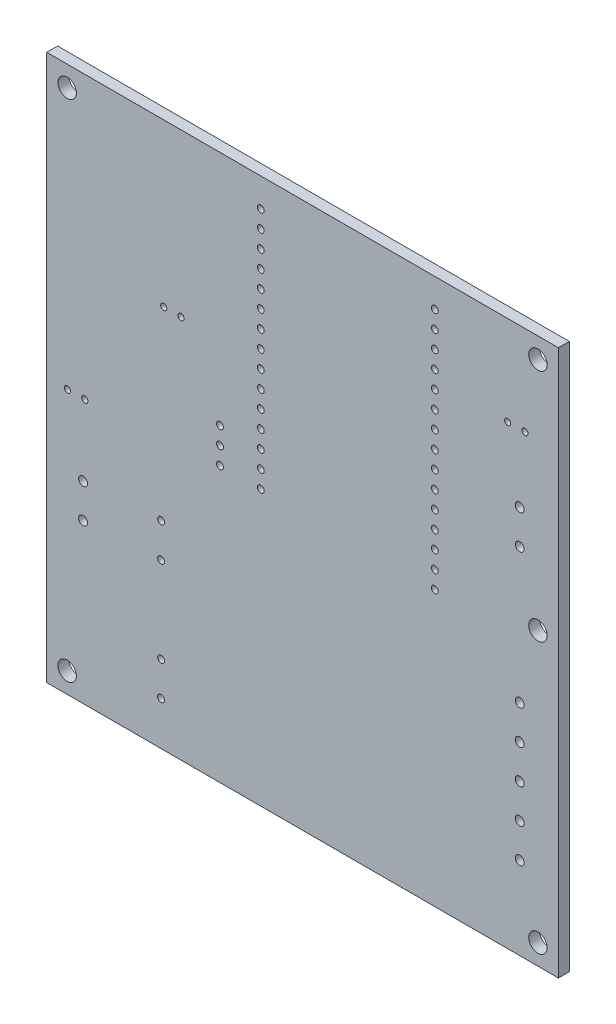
ISO-10303-21;
HEADER;
FILE_DESCRIPTION(('STEP AP214'),'2;1');
FILE_NAME('part.step','',(''),(''),'','','');
FILE_SCHEMA(('AUTOMOTIVE_DESIGN { 1 0 10303 214 1 1 1 1 }'));
ENDSEC;
DATA;
#1=APPLICATION_CONTEXT('core data for automotive mechanical design processes');
#2=APPLICATION_PROTOCOL_DEFINITION('international standard','automotive_design',2000,#1);
#3=PRODUCT_CONTEXT('',#1,'mechanical');
#4=PRODUCT('Part','Part','',(#3));
#5=PRODUCT_RELATED_PRODUCT_CATEGORY('part','',(#4));
#6=PRODUCT_DEFINITION_FORMATION('','',#4);
#7=PRODUCT_DEFINITION_CONTEXT('part definition',#1,'design');
#8=PRODUCT_DEFINITION('design','',#6,#7);
#9=PRODUCT_DEFINITION_SHAPE('','',#8);
#10=(LENGTH_UNIT() NAMED_UNIT(*) SI_UNIT(.MILLI.,.METRE.));
#11=(NAMED_UNIT(*) PLANE_ANGLE_UNIT() SI_UNIT($,.RADIAN.));
#12=(NAMED_UNIT(*) SI_UNIT($,.STERADIAN.) SOLID_ANGLE_UNIT());
#13=UNCERTAINTY_MEASURE_WITH_UNIT(LENGTH_MEASURE(1.E-05),#10,'distance_accuracy_value','');
#14=(GEOMETRIC_REPRESENTATION_CONTEXT(3) GLOBAL_UNCERTAINTY_ASSIGNED_CONTEXT((#13)) GLOBAL_UNIT_ASSIGNED_CONTEXT((#10,
#11,#12)) REPRESENTATION_CONTEXT('',''));
#15=CARTESIAN_POINT('',(0.,0.,0.));
#16=DIRECTION('',(0.,0.,1.));
#17=DIRECTION('',(1.,0.,0.));
#18=AXIS2_PLACEMENT_3D('',#15,#16,#17);
#19=CARTESIAN_POINT('',(0.,0.,1.6));
#20=DIRECTION('',(0.,0.,1.));
#21=DIRECTION('',(1.,0.,0.));
#22=AXIS2_PLACEMENT_3D('',#19,#20,#21);
#23=PLANE('',#22);
#24=CARTESIAN_POINT('',(34.5,37.,1.6));
#25=DIRECTION('',(0.,0.,-1.));
#26=DIRECTION('',(-1.,0.,0.));
#27=AXIS2_PLACEMENT_3D('',#24,#25,#26);
#28=CIRCLE('',#27,1.35);
#29=CARTESIAN_POINT('',(33.15,37.,1.6));
#30=VERTEX_POINT('',#29);
#31=EDGE_CURVE('E251',#30,#30,#28,.T.);
#32=ORIENTED_EDGE('',*,*,#31,.T.);
#33=EDGE_LOOP('',(#32));
#34=FACE_BOUND('',#33,.T.);
#35=CARTESIAN_POINT('',(19.388,35.814,1.6));
#36=DIRECTION('',(0.,0.,-1.));
#37=DIRECTION('',(-1.,0.,0.));
#38=AXIS2_PLACEMENT_3D('',#35,#36,#37);
#39=CIRCLE('',#38,0.5);
#40=CARTESIAN_POINT('',(18.888,35.814,1.6));
#41=VERTEX_POINT('',#40);
#42=EDGE_CURVE('E254',#41,#41,#39,.T.);
#43=ORIENTED_EDGE('',*,*,#42,.T.);
#44=EDGE_LOOP('',(#43));
#45=FACE_BOUND('',#44,.T.);
#46=CARTESIAN_POINT('',(19.388,33.274,1.6));
#47=DIRECTION('',(0.,0.,-1.));
#48=DIRECTION('',(-1.,0.,0.));
#49=AXIS2_PLACEMENT_3D('',#46,#47,#48);
#50=CIRCLE('',#49,0.5);
#51=CARTESIAN_POINT('',(18.888,33.274,1.6));
#52=VERTEX_POINT('',#51);
#53=EDGE_CURVE('E257',#52,#52,#50,.T.);
#54=ORIENTED_EDGE('',*,*,#53,.T.);
#55=EDGE_LOOP('',(#54));
#56=FACE_BOUND('',#55,.T.);
#57=CARTESIAN_POINT('',(19.388,30.734,1.6));
#58=DIRECTION('',(0.,0.,-1.));
#59=DIRECTION('',(-1.,0.,0.));
#60=AXIS2_PLACEMENT_3D('',#57,#58,#59);
#61=CIRCLE('',#60,0.5);
#62=CARTESIAN_POINT('',(18.888,30.734,1.6));
#63=VERTEX_POINT('',#62);
#64=EDGE_CURVE('E260',#63,#63,#61,.T.);
#65=ORIENTED_EDGE('',*,*,#64,.T.);
#66=EDGE_LOOP('',(#65));
#67=FACE_BOUND('',#66,.T.);
#68=CARTESIAN_POINT('',(32.601,26.868,1.6));
#69=DIRECTION('',(0.,0.,-1.));
#70=DIRECTION('',(-1.,0.,0.));
#71=AXIS2_PLACEMENT_3D('',#68,#69,#70);
#72=CIRCLE('',#71,0.45);
#73=CARTESIAN_POINT('',(32.151,26.868,1.6));
#74=VERTEX_POINT('',#73);
#75=EDGE_CURVE('E263',#74,#74,#72,.T.);
#76=ORIENTED_EDGE('',*,*,#75,.T.);
#77=EDGE_LOOP('',(#76));
#78=FACE_BOUND('',#77,.T.);
#79=CARTESIAN_POINT('',(30.061,26.868,1.6));
#80=DIRECTION('',(0.,0.,-1.));
#81=DIRECTION('',(-1.,0.,0.));
#82=AXIS2_PLACEMENT_3D('',#79,#80,#81);
#83=CIRCLE('',#82,0.45);
#84=CARTESIAN_POINT('',(29.611,26.868,1.6));
#85=VERTEX_POINT('',#84);
#86=EDGE_CURVE('E266',#85,#85,#83,.T.);
#87=ORIENTED_EDGE('',*,*,#86,.T.);
#88=EDGE_LOOP('',(#87));
#89=FACE_BOUND('',#88,.T.);
#90=CARTESIAN_POINT('',(19.388,28.194,1.6));
#91=DIRECTION('',(0.,0.,-1.));
#92=DIRECTION('',(-1.,0.,0.));
#93=AXIS2_PLACEMENT_3D('',#90,#91,#92);
#94=CIRCLE('',#93,0.5);
#95=CARTESIAN_POINT('',(18.888,28.194,1.6));
#96=VERTEX_POINT('',#95);
#97=EDGE_CURVE('E269',#96,#96,#94,.T.);
#98=ORIENTED_EDGE('',*,*,#97,.T.);
#99=EDGE_LOOP('',(#98));
#100=FACE_BOUND('',#99,.T.);
#101=CARTESIAN_POINT('',(19.388,25.654,1.6));
#102=DIRECTION('',(0.,0.,-1.));
#103=DIRECTION('',(-1.,0.,0.));
#104=AXIS2_PLACEMENT_3D('',#101,#102,#103);
#105=CIRCLE('',#104,0.5);
#106=CARTESIAN_POINT('',(18.888,25.654,1.6));
#107=VERTEX_POINT('',#106);
#108=EDGE_CURVE('E272',#107,#107,#105,.T.);
#109=ORIENTED_EDGE('',*,*,#108,.T.);
#110=EDGE_LOOP('',(#109));
#111=FACE_BOUND('',#110,.T.);
#112=CARTESIAN_POINT('',(19.388,23.114,1.6));
#113=DIRECTION('',(0.,0.,-1.));
#114=DIRECTION('',(-1.,0.,0.));
#115=AXIS2_PLACEMENT_3D('',#112,#113,#114);
#116=CIRCLE('',#115,0.5);
#117=CARTESIAN_POINT('',(18.888,23.114,1.6));
#118=VERTEX_POINT('',#117);
#119=EDGE_CURVE('E275',#118,#118,#116,.T.);
#120=ORIENTED_EDGE('',*,*,#119,.T.);
#121=EDGE_LOOP('',(#120));
#122=FACE_BOUND('',#121,.T.);
#123=CARTESIAN_POINT('',(19.388,20.574,1.6));
#124=DIRECTION('',(0.,0.,-1.));
#125=DIRECTION('',(-1.,0.,0.));
#126=AXIS2_PLACEMENT_3D('',#123,#124,#125);
#127=CIRCLE('',#126,0.5);
#128=CARTESIAN_POINT('',(18.888,20.574,1.6));
#129=VERTEX_POINT('',#128);
#130=EDGE_CURVE('E278',#129,#129,#127,.T.);
#131=ORIENTED_EDGE('',*,*,#130,.T.);
#132=EDGE_LOOP('',(#131));
#133=FACE_BOUND('',#132,.T.);
#134=CARTESIAN_POINT('',(31.826,16.92,1.6));
#135=DIRECTION('',(0.,0.,-1.));
#136=DIRECTION('',(-1.,0.,0.));
#137=AXIS2_PLACEMENT_3D('',#134,#135,#136);
#138=CIRCLE('',#137,0.65);
#139=CARTESIAN_POINT('',(31.176,16.92,1.6));
#140=VERTEX_POINT('',#139);
#141=EDGE_CURVE('E281',#140,#140,#138,.T.);
#142=ORIENTED_EDGE('',*,*,#141,.T.);
#143=EDGE_LOOP('',(#142));
#144=FACE_BOUND('',#143,.T.);
#145=CARTESIAN_POINT('',(31.826,11.92,1.6));
#146=DIRECTION('',(0.,0.,-1.));
#147=DIRECTION('',(-1.,0.,0.));
#148=AXIS2_PLACEMENT_3D('',#145,#146,#147);
#149=CIRCLE('',#148,0.65);
#150=CARTESIAN_POINT('',(31.176,11.92,1.6));
#151=VERTEX_POINT('',#150);
#152=EDGE_CURVE('E284',#151,#151,#149,.T.);
#153=ORIENTED_EDGE('',*,*,#152,.T.);
#154=EDGE_LOOP('',(#153));
#155=FACE_BOUND('',#154,.T.);
#156=CARTESIAN_POINT('',(19.388,18.034,1.6));
#157=DIRECTION('',(0.,0.,-1.));
#158=DIRECTION('',(-1.,0.,0.));
#159=AXIS2_PLACEMENT_3D('',#156,#157,#158);
#160=CIRCLE('',#159,0.5);
#161=CARTESIAN_POINT('',(18.888,18.034,1.6));
#162=VERTEX_POINT('',#161);
#163=EDGE_CURVE('E287',#162,#162,#160,.T.);
#164=ORIENTED_EDGE('',*,*,#163,.T.);
#165=EDGE_LOOP('',(#164));
#166=FACE_BOUND('',#165,.T.);
#167=CARTESIAN_POINT('',(19.388,15.494,1.6));
#168=DIRECTION('',(0.,0.,-1.));
#169=DIRECTION('',(-1.,0.,0.));
#170=AXIS2_PLACEMENT_3D('',#167,#168,#169);
#171=CIRCLE('',#170,0.5);
#172=CARTESIAN_POINT('',(18.888,15.494,1.6));
#173=VERTEX_POINT('',#172);
#174=EDGE_CURVE('E290',#173,#173,#171,.T.);
#175=ORIENTED_EDGE('',*,*,#174,.T.);
#176=EDGE_LOOP('',(#175));
#177=FACE_BOUND('',#176,.T.);
#178=CARTESIAN_POINT('',(19.388,12.954,1.6));
#179=DIRECTION('',(0.,0.,-1.));
#180=DIRECTION('',(-1.,0.,0.));
#181=AXIS2_PLACEMENT_3D('',#178,#179,#180);
#182=CIRCLE('',#181,0.5);
#183=CARTESIAN_POINT('',(18.888,12.954,1.6));
#184=VERTEX_POINT('',#183);
#185=EDGE_CURVE('E293',#184,#184,#182,.T.);
#186=ORIENTED_EDGE('',*,*,#185,.T.);
#187=EDGE_LOOP('',(#186));
#188=FACE_BOUND('',#187,.T.);
#189=CARTESIAN_POINT('',(19.388,10.414,1.6));
#190=DIRECTION('',(0.,0.,-1.));
#191=DIRECTION('',(-1.,0.,0.));
#192=AXIS2_PLACEMENT_3D('',#189,#190,#191);
#193=CIRCLE('',#192,0.5);
#194=CARTESIAN_POINT('',(18.888,10.414,1.6));
#195=VERTEX_POINT('',#194);
#196=EDGE_CURVE('E296',#195,#195,#193,.T.);
#197=ORIENTED_EDGE('',*,*,#196,.T.);
#198=EDGE_LOOP('',(#197));
#199=FACE_BOUND('',#198,.T.);
#200=CARTESIAN_POINT('',(34.5,2.622,1.6));
#201=DIRECTION('',(0.,0.,-1.));
#202=DIRECTION('',(-1.,0.,0.));
#203=AXIS2_PLACEMENT_3D('',#200,#201,#202);
#204=CIRCLE('',#203,1.35);
#205=CARTESIAN_POINT('',(33.15,2.622,1.6));
#206=VERTEX_POINT('',#205);
#207=EDGE_CURVE('E299',#206,#206,#204,.T.);
#208=ORIENTED_EDGE('',*,*,#207,.T.);
#209=EDGE_LOOP('',(#208));
#210=FACE_BOUND('',#209,.T.);
#211=CARTESIAN_POINT('',(19.388,7.874,1.6));
#212=DIRECTION('',(0.,0.,-1.));
#213=DIRECTION('',(-1.,0.,0.));
#214=AXIS2_PLACEMENT_3D('',#211,#212,#213);
#215=CIRCLE('',#214,0.5);
#216=CARTESIAN_POINT('',(18.888,7.874,1.6));
#217=VERTEX_POINT('',#216);
#218=EDGE_CURVE('E302',#217,#217,#215,.T.);
#219=ORIENTED_EDGE('',*,*,#218,.T.);
#220=EDGE_LOOP('',(#219));
#221=FACE_BOUND('',#220,.T.);
#222=CARTESIAN_POINT('',(19.388,5.334,1.6));
#223=DIRECTION('',(0.,0.,-1.));
#224=DIRECTION('',(-1.,0.,0.));
#225=AXIS2_PLACEMENT_3D('',#222,#223,#224);
#226=CIRCLE('',#225,0.5);
#227=CARTESIAN_POINT('',(18.888,5.334,1.6));
#228=VERTEX_POINT('',#227);
#229=EDGE_CURVE('E305',#228,#228,#226,.T.);
#230=ORIENTED_EDGE('',*,*,#229,.T.);
#231=EDGE_LOOP('',(#230));
#232=FACE_BOUND('',#231,.T.);
#233=CARTESIAN_POINT('',(19.388,2.794,1.6));
#234=DIRECTION('',(0.,0.,-1.));
#235=DIRECTION('',(-1.,0.,0.));
#236=AXIS2_PLACEMENT_3D('',#233,#234,#235);
#237=CIRCLE('',#236,0.5);
#238=CARTESIAN_POINT('',(18.888,2.794,1.6));
#239=VERTEX_POINT('',#238);
#240=EDGE_CURVE('E308',#239,#239,#237,.T.);
#241=ORIENTED_EDGE('',*,*,#240,.T.);
#242=EDGE_LOOP('',(#241));
#243=FACE_BOUND('',#242,.T.);
#244=CARTESIAN_POINT('',(19.388,0.254,1.6));
#245=DIRECTION('',(0.,0.,-1.));
#246=DIRECTION('',(-1.,0.,0.));
#247=AXIS2_PLACEMENT_3D('',#244,#245,#246);
#248=CIRCLE('',#247,0.5);
#249=CARTESIAN_POINT('',(18.888,0.254,1.6));
#250=VERTEX_POINT('',#249);
#251=EDGE_CURVE('E311',#250,#250,#248,.T.);
#252=ORIENTED_EDGE('',*,*,#251,.T.);
#253=EDGE_LOOP('',(#252));
#254=FACE_BOUND('',#253,.T.);
#255=CARTESIAN_POINT('',(-6.112,35.814,1.6));
#256=DIRECTION('',(0.,0.,-1.));
#257=DIRECTION('',(-1.,0.,0.));
#258=AXIS2_PLACEMENT_3D('',#255,#256,#257);
#259=CIRCLE('',#258,0.5);
#260=CARTESIAN_POINT('',(-6.612,35.814,1.6));
#261=VERTEX_POINT('',#260);
#262=EDGE_CURVE('E314',#261,#261,#259,.T.);
#263=ORIENTED_EDGE('',*,*,#262,.T.);
#264=EDGE_LOOP('',(#263));
#265=FACE_BOUND('',#264,.T.);
#266=CARTESIAN_POINT('',(-6.112,33.274,1.6));
#267=DIRECTION('',(0.,0.,-1.));
#268=DIRECTION('',(-1.,0.,0.));
#269=AXIS2_PLACEMENT_3D('',#266,#267,#268);
#270=CIRCLE('',#269,0.5);
#271=CARTESIAN_POINT('',(-6.612,33.274,1.6));
#272=VERTEX_POINT('',#271);
#273=EDGE_CURVE('E317',#272,#272,#270,.T.);
#274=ORIENTED_EDGE('',*,*,#273,.T.);
#275=EDGE_LOOP('',(#274));
#276=FACE_BOUND('',#275,.T.);
#277=CARTESIAN_POINT('',(-6.112,30.734,1.6));
#278=DIRECTION('',(0.,0.,-1.));
#279=DIRECTION('',(-1.,0.,0.));
#280=AXIS2_PLACEMENT_3D('',#277,#278,#279);
#281=CIRCLE('',#280,0.5);
#282=CARTESIAN_POINT('',(-6.612,30.734,1.6));
#283=VERTEX_POINT('',#282);
#284=EDGE_CURVE('E320',#283,#283,#281,.T.);
#285=ORIENTED_EDGE('',*,*,#284,.T.);
#286=EDGE_LOOP('',(#285));
#287=FACE_BOUND('',#286,.T.);
#288=CARTESIAN_POINT('',(-6.112,28.194,1.6));
#289=DIRECTION('',(0.,0.,-1.));
#290=DIRECTION('',(-1.,0.,0.));
#291=AXIS2_PLACEMENT_3D('',#288,#289,#290);
#292=CIRCLE('',#291,0.5);
#293=CARTESIAN_POINT('',(-6.612,28.194,1.6));
#294=VERTEX_POINT('',#293);
#295=EDGE_CURVE('E323',#294,#294,#292,.T.);
#296=ORIENTED_EDGE('',*,*,#295,.T.);
#297=EDGE_LOOP('',(#296));
#298=FACE_BOUND('',#297,.T.);
#299=CARTESIAN_POINT('',(-6.112,25.654,1.6));
#300=DIRECTION('',(0.,0.,-1.));
#301=DIRECTION('',(-1.,0.,0.));
#302=AXIS2_PLACEMENT_3D('',#299,#300,#301);
#303=CIRCLE('',#302,0.5);
#304=CARTESIAN_POINT('',(-6.612,25.654,1.6));
#305=VERTEX_POINT('',#304);
#306=EDGE_CURVE('E326',#305,#305,#303,.T.);
#307=ORIENTED_EDGE('',*,*,#306,.T.);
#308=EDGE_LOOP('',(#307));
#309=FACE_BOUND('',#308,.T.);
#310=CARTESIAN_POINT('',(-6.112,23.114,1.6));
#311=DIRECTION('',(0.,0.,-1.));
#312=DIRECTION('',(-1.,0.,0.));
#313=AXIS2_PLACEMENT_3D('',#310,#311,#312);
#314=CIRCLE('',#313,0.5);
#315=CARTESIAN_POINT('',(-6.612,23.114,1.6));
#316=VERTEX_POINT('',#315);
#317=EDGE_CURVE('E329',#316,#316,#314,.T.);
#318=ORIENTED_EDGE('',*,*,#317,.T.);
#319=EDGE_LOOP('',(#318));
#320=FACE_BOUND('',#319,.T.);
#321=CARTESIAN_POINT('',(-6.112,20.574,1.6));
#322=DIRECTION('',(0.,0.,-1.));
#323=DIRECTION('',(-1.,0.,0.));
#324=AXIS2_PLACEMENT_3D('',#321,#322,#323);
#325=CIRCLE('',#324,0.5);
#326=CARTESIAN_POINT('',(-6.612,20.574,1.6));
#327=VERTEX_POINT('',#326);
#328=EDGE_CURVE('E332',#327,#327,#325,.T.);
#329=ORIENTED_EDGE('',*,*,#328,.T.);
#330=EDGE_LOOP('',(#329));
#331=FACE_BOUND('',#330,.T.);
#332=CARTESIAN_POINT('',(-34.5,37.,1.6));
#333=DIRECTION('',(0.,0.,-1.));
#334=DIRECTION('',(-1.,0.,0.));
#335=AXIS2_PLACEMENT_3D('',#332,#333,#334);
#336=CIRCLE('',#335,1.35);
#337=CARTESIAN_POINT('',(-35.85,37.,1.6));
#338=VERTEX_POINT('',#337);
#339=EDGE_CURVE('E335',#338,#338,#336,.T.);
#340=ORIENTED_EDGE('',*,*,#339,.T.);
#341=EDGE_LOOP('',(#340));
#342=FACE_BOUND('',#341,.T.);
#343=CARTESIAN_POINT('',(-6.112,18.034,1.6));
#344=DIRECTION('',(0.,0.,-1.));
#345=DIRECTION('',(-1.,0.,0.));
#346=AXIS2_PLACEMENT_3D('',#343,#344,#345);
#347=CIRCLE('',#346,0.5);
#348=CARTESIAN_POINT('',(-6.612,18.034,1.6));
#349=VERTEX_POINT('',#348);
#350=EDGE_CURVE('E338',#349,#349,#347,.T.);
#351=ORIENTED_EDGE('',*,*,#350,.T.);
#352=EDGE_LOOP('',(#351));
#353=FACE_BOUND('',#352,.T.);
#354=CARTESIAN_POINT('',(-6.112,15.494,1.6));
#355=DIRECTION('',(0.,0.,-1.));
#356=DIRECTION('',(-1.,0.,0.));
#357=AXIS2_PLACEMENT_3D('',#354,#355,#356);
#358=CIRCLE('',#357,0.5);
#359=CARTESIAN_POINT('',(-6.612,15.494,1.6));
#360=VERTEX_POINT('',#359);
#361=EDGE_CURVE('E341',#360,#360,#358,.T.);
#362=ORIENTED_EDGE('',*,*,#361,.T.);
#363=EDGE_LOOP('',(#362));
#364=FACE_BOUND('',#363,.T.);
#365=CARTESIAN_POINT('',(-6.112,12.954,1.6));
#366=DIRECTION('',(0.,0.,-1.));
#367=DIRECTION('',(-1.,0.,0.));
#368=AXIS2_PLACEMENT_3D('',#365,#366,#367);
#369=CIRCLE('',#368,0.5);
#370=CARTESIAN_POINT('',(-6.612,12.954,1.6));
#371=VERTEX_POINT('',#370);
#372=EDGE_CURVE('E344',#371,#371,#369,.T.);
#373=ORIENTED_EDGE('',*,*,#372,.T.);
#374=EDGE_LOOP('',(#373));
#375=FACE_BOUND('',#374,.T.);
#376=CARTESIAN_POINT('',(-6.112,10.414,1.6));
#377=DIRECTION('',(0.,0.,-1.));
#378=DIRECTION('',(-1.,0.,0.));
#379=AXIS2_PLACEMENT_3D('',#376,#377,#378);
#380=CIRCLE('',#379,0.5);
#381=CARTESIAN_POINT('',(-6.612,10.414,1.6));
#382=VERTEX_POINT('',#381);
#383=EDGE_CURVE('E347',#382,#382,#380,.T.);
#384=ORIENTED_EDGE('',*,*,#383,.T.);
#385=EDGE_LOOP('',(#384));
#386=FACE_BOUND('',#385,.T.);
#387=CARTESIAN_POINT('',(-17.805,16.256,1.6));
#388=DIRECTION('',(0.,0.,-1.));
#389=DIRECTION('',(-1.,0.,0.));
#390=AXIS2_PLACEMENT_3D('',#387,#388,#389);
#391=CIRCLE('',#390,0.45);
#392=CARTESIAN_POINT('',(-18.255,16.256,1.6));
#393=VERTEX_POINT('',#392);
#394=EDGE_CURVE('E350',#393,#393,#391,.T.);
#395=ORIENTED_EDGE('',*,*,#394,.T.);
#396=EDGE_LOOP('',(#395));
#397=FACE_BOUND('',#396,.T.);
#398=CARTESIAN_POINT('',(-6.112,7.874,1.6));
#399=DIRECTION('',(0.,0.,-1.));
#400=DIRECTION('',(-1.,0.,0.));
#401=AXIS2_PLACEMENT_3D('',#398,#399,#400);
#402=CIRCLE('',#401,0.5);
#403=CARTESIAN_POINT('',(-6.612,7.874,1.6));
#404=VERTEX_POINT('',#403);
#405=EDGE_CURVE('E353',#404,#404,#402,.T.);
#406=ORIENTED_EDGE('',*,*,#405,.T.);
#407=EDGE_LOOP('',(#406));
#408=FACE_BOUND('',#407,.T.);
#409=CARTESIAN_POINT('',(-6.112,5.334,1.6));
#410=DIRECTION('',(0.,0.,-1.));
#411=DIRECTION('',(-1.,0.,0.));
#412=AXIS2_PLACEMENT_3D('',#409,#410,#411);
#413=CIRCLE('',#412,0.5);
#414=CARTESIAN_POINT('',(-6.612,5.334,1.6));
#415=VERTEX_POINT('',#414);
#416=EDGE_CURVE('E356',#415,#415,#413,.T.);
#417=ORIENTED_EDGE('',*,*,#416,.T.);
#418=EDGE_LOOP('',(#417));
#419=FACE_BOUND('',#418,.T.);
#420=CARTESIAN_POINT('',(-6.112,2.794,1.6));
#421=DIRECTION('',(0.,0.,-1.));
#422=DIRECTION('',(-1.,0.,0.));
#423=AXIS2_PLACEMENT_3D('',#420,#421,#422);
#424=CIRCLE('',#423,0.5);
#425=CARTESIAN_POINT('',(-6.612,2.794,1.6));
#426=VERTEX_POINT('',#425);
#427=EDGE_CURVE('E359',#426,#426,#424,.T.);
#428=ORIENTED_EDGE('',*,*,#427,.T.);
#429=EDGE_LOOP('',(#428));
#430=FACE_BOUND('',#429,.T.);
#431=CARTESIAN_POINT('',(-6.112,0.254,1.6));
#432=DIRECTION('',(0.,0.,-1.));
#433=DIRECTION('',(-1.,0.,0.));
#434=AXIS2_PLACEMENT_3D('',#431,#432,#433);
#435=CIRCLE('',#434,0.5);
#436=CARTESIAN_POINT('',(-6.612,0.254,1.6));
#437=VERTEX_POINT('',#436);
#438=EDGE_CURVE('E362',#437,#437,#435,.T.);
#439=ORIENTED_EDGE('',*,*,#438,.T.);
#440=EDGE_LOOP('',(#439));
#441=FACE_BOUND('',#440,.T.);
#442=CARTESIAN_POINT('',(-12.1,5.334,1.6));
#443=DIRECTION('',(0.,0.,-1.));
#444=DIRECTION('',(-1.,0.,0.));
#445=AXIS2_PLACEMENT_3D('',#442,#443,#444);
#446=CIRCLE('',#445,0.5);
#447=CARTESIAN_POINT('',(-12.6,5.334,1.6));
#448=VERTEX_POINT('',#447);
#449=EDGE_CURVE('E365',#448,#448,#446,.T.);
#450=ORIENTED_EDGE('',*,*,#449,.T.);
#451=EDGE_LOOP('',(#450));
#452=FACE_BOUND('',#451,.T.);
#453=CARTESIAN_POINT('',(-12.1,2.794,1.6));
#454=DIRECTION('',(0.,0.,-1.));
#455=DIRECTION('',(-1.,0.,0.));
#456=AXIS2_PLACEMENT_3D('',#453,#454,#455);
#457=CIRCLE('',#456,0.5);
#458=CARTESIAN_POINT('',(-12.6,2.794,1.6));
#459=VERTEX_POINT('',#458);
#460=EDGE_CURVE('E368',#459,#459,#457,.T.);
#461=ORIENTED_EDGE('',*,*,#460,.T.);
#462=EDGE_LOOP('',(#461));
#463=FACE_BOUND('',#462,.T.);
#464=CARTESIAN_POINT('',(-12.1,0.254,1.6));
#465=DIRECTION('',(0.,0.,-1.));
#466=DIRECTION('',(-1.,0.,0.));
#467=AXIS2_PLACEMENT_3D('',#464,#465,#466);
#468=CIRCLE('',#467,0.5);
#469=CARTESIAN_POINT('',(-12.6,0.254,1.6));
#470=VERTEX_POINT('',#469);
#471=EDGE_CURVE('E371',#470,#470,#468,.T.);
#472=ORIENTED_EDGE('',*,*,#471,.T.);
#473=EDGE_LOOP('',(#472));
#474=FACE_BOUND('',#473,.T.);
#475=CARTESIAN_POINT('',(-20.345,16.256,1.6));
#476=DIRECTION('',(0.,0.,-1.));
#477=DIRECTION('',(-1.,0.,0.));
#478=AXIS2_PLACEMENT_3D('',#475,#476,#477);
#479=CIRCLE('',#478,0.45);
#480=CARTESIAN_POINT('',(-20.795,16.256,1.6));
#481=VERTEX_POINT('',#480);
#482=EDGE_CURVE('E374',#481,#481,#479,.T.);
#483=ORIENTED_EDGE('',*,*,#482,.T.);
#484=EDGE_LOOP('',(#483));
#485=FACE_BOUND('',#484,.T.);
#486=CARTESIAN_POINT('',(31.826,-7.874,1.6));
#487=DIRECTION('',(0.,0.,-1.));
#488=DIRECTION('',(-1.,0.,0.));
#489=AXIS2_PLACEMENT_3D('',#486,#487,#488);
#490=CIRCLE('',#489,0.65);
#491=CARTESIAN_POINT('',(31.176,-7.874,1.6));
#492=VERTEX_POINT('',#491);
#493=EDGE_CURVE('E377',#492,#492,#490,.T.);
#494=ORIENTED_EDGE('',*,*,#493,.T.);
#495=EDGE_LOOP('',(#494));
#496=FACE_BOUND('',#495,.T.);
#497=CARTESIAN_POINT('',(31.826,-12.874,1.6));
#498=DIRECTION('',(0.,0.,-1.));
#499=DIRECTION('',(-1.,0.,0.));
#500=AXIS2_PLACEMENT_3D('',#497,#498,#499);
#501=CIRCLE('',#500,0.65);
#502=CARTESIAN_POINT('',(31.176,-12.874,1.6));
#503=VERTEX_POINT('',#502);
#504=EDGE_CURVE('E380',#503,#503,#501,.T.);
#505=ORIENTED_EDGE('',*,*,#504,.T.);
#506=EDGE_LOOP('',(#505));
#507=FACE_BOUND('',#506,.T.);
#508=CARTESIAN_POINT('',(31.826,-17.874,1.6));
#509=DIRECTION('',(0.,0.,-1.));
#510=DIRECTION('',(-1.,0.,0.));
#511=AXIS2_PLACEMENT_3D('',#508,#509,#510);
#512=CIRCLE('',#511,0.65);
#513=CARTESIAN_POINT('',(31.176,-17.874,1.6));
#514=VERTEX_POINT('',#513);
#515=EDGE_CURVE('E383',#514,#514,#512,.T.);
#516=ORIENTED_EDGE('',*,*,#515,.T.);
#517=EDGE_LOOP('',(#516));
#518=FACE_BOUND('',#517,.T.);
#519=CARTESIAN_POINT('',(31.826,-22.874,1.6));
#520=DIRECTION('',(0.,0.,-1.));
#521=DIRECTION('',(-1.,0.,0.));
#522=AXIS2_PLACEMENT_3D('',#519,#520,#521);
#523=CIRCLE('',#522,0.65);
#524=CARTESIAN_POINT('',(31.176,-22.874,1.6));
#525=VERTEX_POINT('',#524);
#526=EDGE_CURVE('E386',#525,#525,#523,.T.);
#527=ORIENTED_EDGE('',*,*,#526,.T.);
#528=EDGE_LOOP('',(#527));
#529=FACE_BOUND('',#528,.T.);
#530=CARTESIAN_POINT('',(31.826,-27.874,1.6));
#531=DIRECTION('',(0.,0.,-1.));
#532=DIRECTION('',(-1.,0.,0.));
#533=AXIS2_PLACEMENT_3D('',#530,#531,#532);
#534=CIRCLE('',#533,0.65);
#535=CARTESIAN_POINT('',(31.176,-27.874,1.6));
#536=VERTEX_POINT('',#535);
#537=EDGE_CURVE('E389',#536,#536,#534,.T.);
#538=ORIENTED_EDGE('',*,*,#537,.T.);
#539=EDGE_LOOP('',(#538));
#540=FACE_BOUND('',#539,.T.);
#541=CARTESIAN_POINT('',(34.5,-37.,1.6));
#542=DIRECTION('',(0.,0.,-1.));
#543=DIRECTION('',(-1.,0.,0.));
#544=AXIS2_PLACEMENT_3D('',#541,#542,#543);
#545=CIRCLE('',#544,1.35);
#546=CARTESIAN_POINT('',(33.15,-37.,1.6));
#547=VERTEX_POINT('',#546);
#548=EDGE_CURVE('E392',#547,#547,#545,.T.);
#549=ORIENTED_EDGE('',*,*,#548,.T.);
#550=EDGE_LOOP('',(#549));
#551=FACE_BOUND('',#550,.T.);
#552=CARTESIAN_POINT('',(-31.912,-1.27,1.6));
#553=DIRECTION('',(0.,0.,-1.));
#554=DIRECTION('',(-1.,0.,0.));
#555=AXIS2_PLACEMENT_3D('',#552,#553,#554);
#556=CIRCLE('',#555,0.45);
#557=CARTESIAN_POINT('',(-32.362,-1.27,1.6));
#558=VERTEX_POINT('',#557);
#559=EDGE_CURVE('E395',#558,#558,#556,.T.);
#560=ORIENTED_EDGE('',*,*,#559,.T.);
#561=EDGE_LOOP('',(#560));
#562=FACE_BOUND('',#561,.T.);
#563=CARTESIAN_POINT('',(-34.452,-1.27,1.6));
#564=DIRECTION('',(0.,0.,-1.));
#565=DIRECTION('',(-1.,0.,0.));
#566=AXIS2_PLACEMENT_3D('',#563,#564,#565);
#567=CIRCLE('',#566,0.45);
#568=CARTESIAN_POINT('',(-34.902,-1.27,1.6));
#569=VERTEX_POINT('',#568);
#570=EDGE_CURVE('E398',#569,#569,#567,.T.);
#571=ORIENTED_EDGE('',*,*,#570,.T.);
#572=EDGE_LOOP('',(#571));
#573=FACE_BOUND('',#572,.T.);
#574=CARTESIAN_POINT('',(-20.736,-11.0607,1.6));
#575=DIRECTION('',(0.,0.,-1.));
#576=DIRECTION('',(-1.,0.,0.));
#577=AXIS2_PLACEMENT_3D('',#574,#575,#576);
#578=CIRCLE('',#577,0.5);
#579=CARTESIAN_POINT('',(-21.236,-11.0607,1.6));
#580=VERTEX_POINT('',#579);
#581=EDGE_CURVE('E401',#580,#580,#578,.T.);
#582=ORIENTED_EDGE('',*,*,#581,.T.);
#583=EDGE_LOOP('',(#582));
#584=FACE_BOUND('',#583,.T.);
#585=CARTESIAN_POINT('',(-20.736,-16.0607,1.6));
#586=DIRECTION('',(0.,0.,-1.));
#587=DIRECTION('',(-1.,0.,0.));
#588=AXIS2_PLACEMENT_3D('',#585,#586,#587);
#589=CIRCLE('',#588,0.5);
#590=CARTESIAN_POINT('',(-21.236,-16.0607,1.6));
#591=VERTEX_POINT('',#590);
#592=EDGE_CURVE('E404',#591,#591,#589,.T.);
#593=ORIENTED_EDGE('',*,*,#592,.T.);
#594=EDGE_LOOP('',(#593));
#595=FACE_BOUND('',#594,.T.);
#596=CARTESIAN_POINT('',(-32.166,-11.764,1.6));
#597=DIRECTION('',(0.,0.,-1.));
#598=DIRECTION('',(-1.,0.,0.));
#599=AXIS2_PLACEMENT_3D('',#596,#597,#598);
#600=CIRCLE('',#599,0.65);
#601=CARTESIAN_POINT('',(-32.816,-11.764,1.6));
#602=VERTEX_POINT('',#601);
#603=EDGE_CURVE('E407',#602,#602,#600,.T.);
#604=ORIENTED_EDGE('',*,*,#603,.T.);
#605=EDGE_LOOP('',(#604));
#606=FACE_BOUND('',#605,.T.);
#607=CARTESIAN_POINT('',(-32.166,-16.764,1.6));
#608=DIRECTION('',(0.,0.,-1.));
#609=DIRECTION('',(-1.,0.,0.));
#610=AXIS2_PLACEMENT_3D('',#607,#608,#609);
#611=CIRCLE('',#610,0.65);
#612=CARTESIAN_POINT('',(-32.816,-16.764,1.6));
#613=VERTEX_POINT('',#612);
#614=EDGE_CURVE('E410',#613,#613,#611,.T.);
#615=ORIENTED_EDGE('',*,*,#614,.T.);
#616=EDGE_LOOP('',(#615));
#617=FACE_BOUND('',#616,.T.);
#618=CARTESIAN_POINT('',(-20.736,-28.641,1.6));
#619=DIRECTION('',(0.,0.,-1.));
#620=DIRECTION('',(-1.,0.,0.));
#621=AXIS2_PLACEMENT_3D('',#618,#619,#620);
#622=CIRCLE('',#621,0.5);
#623=CARTESIAN_POINT('',(-21.236,-28.641,1.6));
#624=VERTEX_POINT('',#623);
#625=EDGE_CURVE('E413',#624,#624,#622,.T.);
#626=ORIENTED_EDGE('',*,*,#625,.T.);
#627=EDGE_LOOP('',(#626));
#628=FACE_BOUND('',#627,.T.);
#629=CARTESIAN_POINT('',(-20.736,-33.641,1.6));
#630=DIRECTION('',(0.,0.,-1.));
#631=DIRECTION('',(-1.,0.,0.));
#632=AXIS2_PLACEMENT_3D('',#629,#630,#631);
#633=CIRCLE('',#632,0.5);
#634=CARTESIAN_POINT('',(-21.236,-33.641,1.6));
#635=VERTEX_POINT('',#634);
#636=EDGE_CURVE('E415',#635,#635,#633,.T.);
#637=ORIENTED_EDGE('',*,*,#636,.T.);
#638=EDGE_LOOP('',(#637));
#639=FACE_BOUND('',#638,.T.);
#640=CARTESIAN_POINT('',(-34.5,-37.,1.6));
#641=DIRECTION('',(0.,0.,-1.));
#642=DIRECTION('',(-1.,0.,0.));
#643=AXIS2_PLACEMENT_3D('',#640,#641,#642);
#644=CIRCLE('',#643,1.35);
#645=CARTESIAN_POINT('',(-35.85,-37.,1.6));
#646=VERTEX_POINT('',#645);
#647=EDGE_CURVE('E20',#646,#646,#644,.T.);
#648=ORIENTED_EDGE('',*,*,#647,.T.);
#649=EDGE_LOOP('',(#648));
#650=FACE_BOUND('',#649,.T.);
#651=DIRECTION('',(1.,0.,0.));
#652=VECTOR('',#651,1.);
#653=CARTESIAN_POINT('',(-37.5,40.,1.6));
#654=LINE('',#653,#652);
#655=CARTESIAN_POINT('',(-37.5,40.,1.6));
#656=VERTEX_POINT('',#655);
#657=CARTESIAN_POINT('',(37.5,40.,1.6));
#658=VERTEX_POINT('',#657);
#659=EDGE_CURVE('E54',#656,#658,#654,.T.);
#660=ORIENTED_EDGE('',*,*,#659,.F.);
#661=DIRECTION('',(0.,1.,0.));
#662=VECTOR('',#661,1.);
#663=CARTESIAN_POINT('',(-37.5,-40.,1.6));
#664=LINE('',#663,#662);
#665=CARTESIAN_POINT('',(-37.5,-40.,1.6));
#666=VERTEX_POINT('',#665);
#667=EDGE_CURVE('E71',#666,#656,#664,.T.);
#668=ORIENTED_EDGE('',*,*,#667,.F.);
#669=DIRECTION('',(1.,0.,0.));
#670=VECTOR('',#669,1.);
#671=CARTESIAN_POINT('',(37.5,-40.,1.6));
#672=LINE('',#671,#670);
#673=CARTESIAN_POINT('',(37.5,-40.,1.6));
#674=VERTEX_POINT('',#673);
#675=EDGE_CURVE('E68',#674,#666,#672,.F.);
#676=ORIENTED_EDGE('',*,*,#675,.F.);
#677=DIRECTION('',(0.,1.,0.));
#678=VECTOR('',#677,1.);
#679=CARTESIAN_POINT('',(37.5,40.,1.6));
#680=LINE('',#679,#678);
#681=EDGE_CURVE('E59',#658,#674,#680,.F.);
#682=ORIENTED_EDGE('',*,*,#681,.F.);
#683=EDGE_LOOP('',(#660,#668,#676,#682));
#684=FACE_BOUND('',#683,.T.);
#685=ADVANCED_FACE('F17',(#34,#45,#56,#67,#78,#89,#100,#111,#122,#133,#144,#155,#166,#177,#188,
#199,#210,#221,#232,#243,#254,#265,#276,#287,#298,#309,#320,#331,#342,#353,#364,#375,#386,#397,
#408,#419,#430,#441,#452,#463,#474,#485,#496,#507,#518,#529,#540,#551,#562,#573,#584,#595,#606,
#617,#628,#639,#650,#684),#23,.T.);
#686=CARTESIAN_POINT('',(37.5,-40.,0.));
#687=DIRECTION('',(0.,-1.,0.));
#688=DIRECTION('',(0.,0.,-1.));
#689=AXIS2_PLACEMENT_3D('',#686,#687,#688);
#690=PLANE('',#689);
#691=DIRECTION('',(0.,0.,1.));
#692=VECTOR('',#691,1.);
#693=CARTESIAN_POINT('',(-37.5,-40.,0.));
#694=LINE('',#693,#692);
#695=CARTESIAN_POINT('',(-37.5,-40.,0.));
#696=VERTEX_POINT('',#695);
#697=EDGE_CURVE('E423',#696,#666,#694,.T.);
#698=ORIENTED_EDGE('',*,*,#697,.F.);
#699=DIRECTION('',(1.,0.,0.));
#700=VECTOR('',#699,1.);
#701=CARTESIAN_POINT('',(0.,-40.,0.));
#702=LINE('',#701,#700);
#703=CARTESIAN_POINT('',(37.5,-40.,0.));
#704=VERTEX_POINT('',#703);
#705=EDGE_CURVE('E78',#696,#704,#702,.T.);
#706=ORIENTED_EDGE('',*,*,#705,.T.);
#707=DIRECTION('',(0.,0.,-1.));
#708=VECTOR('',#707,1.);
#709=CARTESIAN_POINT('',(37.5,-40.,0.));
#710=LINE('',#709,#708);
#711=EDGE_CURVE('E64',#674,#704,#710,.T.);
#712=ORIENTED_EDGE('',*,*,#711,.F.);
#713=ORIENTED_EDGE('',*,*,#675,.T.);
#714=EDGE_LOOP('',(#698,#706,#712,#713));
#715=FACE_BOUND('',#714,.T.);
#716=ADVANCED_FACE('F77',(#715),#690,.T.);
#717=CARTESIAN_POINT('',(37.5,40.,0.));
#718=DIRECTION('',(1.,0.,0.));
#719=DIRECTION('',(0.,0.,-1.));
#720=AXIS2_PLACEMENT_3D('',#717,#718,#719);
#721=PLANE('',#720);
#722=ORIENTED_EDGE('',*,*,#711,.T.);
#723=DIRECTION('',(0.,1.,0.));
#724=VECTOR('',#723,1.);
#725=CARTESIAN_POINT('',(37.5,0.,0.));
#726=LINE('',#725,#724);
#727=CARTESIAN_POINT('',(37.5,40.,0.));
#728=VERTEX_POINT('',#727);
#729=EDGE_CURVE('E434',#704,#728,#726,.T.);
#730=ORIENTED_EDGE('',*,*,#729,.T.);
#731=DIRECTION('',(0.,0.,1.));
#732=VECTOR('',#731,1.);
#733=CARTESIAN_POINT('',(37.5,40.,0.));
#734=LINE('',#733,#732);
#735=EDGE_CURVE('E66',#658,#728,#734,.F.);
#736=ORIENTED_EDGE('',*,*,#735,.F.);
#737=ORIENTED_EDGE('',*,*,#681,.T.);
#738=EDGE_LOOP('',(#722,#730,#736,#737));
#739=FACE_BOUND('',#738,.T.);
#740=ADVANCED_FACE('F61',(#739),#721,.T.);
#741=CARTESIAN_POINT('',(-37.5,40.,0.));
#742=DIRECTION('',(0.,1.,0.));
#743=DIRECTION('',(0.,0.,1.));
#744=AXIS2_PLACEMENT_3D('',#741,#742,#743);
#745=PLANE('',#744);
#746=ORIENTED_EDGE('',*,*,#735,.T.);
#747=DIRECTION('',(1.,0.,0.));
#748=VECTOR('',#747,1.);
#749=CARTESIAN_POINT('',(0.,40.,0.));
#750=LINE('',#749,#748);
#751=CARTESIAN_POINT('',(-37.5,40.,0.));
#752=VERTEX_POINT('',#751);
#753=EDGE_CURVE('E431',#728,#752,#750,.F.);
#754=ORIENTED_EDGE('',*,*,#753,.T.);
#755=DIRECTION('',(0.,0.,1.));
#756=VECTOR('',#755,1.);
#757=CARTESIAN_POINT('',(-37.5,40.,0.));
#758=LINE('',#757,#756);
#759=EDGE_CURVE('E35',#656,#752,#758,.F.);
#760=ORIENTED_EDGE('',*,*,#759,.F.);
#761=ORIENTED_EDGE('',*,*,#659,.T.);
#762=EDGE_LOOP('',(#746,#754,#760,#761));
#763=FACE_BOUND('',#762,.T.);
#764=ADVANCED_FACE('F430',(#763),#745,.T.);
#765=CARTESIAN_POINT('',(-37.5,-40.,0.));
#766=DIRECTION('',(-1.,0.,0.));
#767=DIRECTION('',(0.,0.,1.));
#768=AXIS2_PLACEMENT_3D('',#765,#766,#767);
#769=PLANE('',#768);
#770=ORIENTED_EDGE('',*,*,#759,.T.);
#771=DIRECTION('',(0.,1.,0.));
#772=VECTOR('',#771,1.);
#773=CARTESIAN_POINT('',(-37.5,0.,0.));
#774=LINE('',#773,#772);
#775=EDGE_CURVE('E250',#752,#696,#774,.F.);
#776=ORIENTED_EDGE('',*,*,#775,.T.);
#777=ORIENTED_EDGE('',*,*,#697,.T.);
#778=ORIENTED_EDGE('',*,*,#667,.T.);
#779=EDGE_LOOP('',(#770,#776,#777,#778));
#780=FACE_BOUND('',#779,.T.);
#781=ADVANCED_FACE('F437',(#780),#769,.T.);
#782=CARTESIAN_POINT('',(-34.5,-37.,-0.045));
#783=DIRECTION('',(0.,0.,-1.));
#784=DIRECTION('',(-1.,0.,0.));
#785=AXIS2_PLACEMENT_3D('',#782,#783,#784);
#786=CYLINDRICAL_SURFACE('',#785,1.35);
#787=ORIENTED_EDGE('',*,*,#647,.F.);
#788=EDGE_LOOP('',(#787));
#789=FACE_BOUND('',#788,.T.);
#790=CARTESIAN_POINT('',(-34.5,-37.,0.));
#791=DIRECTION('',(0.,0.,-1.));
#792=DIRECTION('',(-1.,0.,0.));
#793=AXIS2_PLACEMENT_3D('',#790,#791,#792);
#794=CIRCLE('',#793,1.35);
#795=CARTESIAN_POINT('',(-35.85,-37.,0.));
#796=VERTEX_POINT('',#795);
#797=EDGE_CURVE('E247',#796,#796,#794,.T.);
#798=ORIENTED_EDGE('',*,*,#797,.T.);
#799=EDGE_LOOP('',(#798));
#800=FACE_BOUND('',#799,.T.);
#801=ADVANCED_FACE('F439',(#789,#800),#786,.F.);
#802=CARTESIAN_POINT('',(-20.736,-33.641,-0.045));
#803=DIRECTION('',(0.,0.,-1.));
#804=DIRECTION('',(-1.,0.,0.));
#805=AXIS2_PLACEMENT_3D('',#802,#803,#804);
#806=CYLINDRICAL_SURFACE('',#805,0.5);
#807=ORIENTED_EDGE('',*,*,#636,.F.);
#808=EDGE_LOOP('',(#807));
#809=FACE_BOUND('',#808,.T.);
#810=CARTESIAN_POINT('',(-20.736,-33.641,0.));
#811=DIRECTION('',(0.,0.,-1.));
#812=DIRECTION('',(-1.,0.,0.));
#813=AXIS2_PLACEMENT_3D('',#810,#811,#812);
#814=CIRCLE('',#813,0.5);
#815=CARTESIAN_POINT('',(-21.236,-33.641,0.));
#816=VERTEX_POINT('',#815);
#817=EDGE_CURVE('E244',#816,#816,#814,.T.);
#818=ORIENTED_EDGE('',*,*,#817,.T.);
#819=EDGE_LOOP('',(#818));
#820=FACE_BOUND('',#819,.T.);
#821=ADVANCED_FACE('F446',(#809,#820),#806,.F.);
#822=CARTESIAN_POINT('',(-20.736,-28.641,-0.045));
#823=DIRECTION('',(0.,0.,-1.));
#824=DIRECTION('',(-1.,0.,0.));
#825=AXIS2_PLACEMENT_3D('',#822,#823,#824);
#826=CYLINDRICAL_SURFACE('',#825,0.5);
#827=ORIENTED_EDGE('',*,*,#625,.F.);
#828=EDGE_LOOP('',(#827));
#829=FACE_BOUND('',#828,.T.);
#830=CARTESIAN_POINT('',(-20.736,-28.641,0.));
#831=DIRECTION('',(0.,0.,-1.));
#832=DIRECTION('',(-1.,0.,0.));
#833=AXIS2_PLACEMENT_3D('',#830,#831,#832);
#834=CIRCLE('',#833,0.5);
#835=CARTESIAN_POINT('',(-21.236,-28.641,0.));
#836=VERTEX_POINT('',#835);
#837=EDGE_CURVE('E241',#836,#836,#834,.T.);
#838=ORIENTED_EDGE('',*,*,#837,.T.);
#839=EDGE_LOOP('',(#838));
#840=FACE_BOUND('',#839,.T.);
#841=ADVANCED_FACE('F673',(#829,#840),#826,.F.);
#842=CARTESIAN_POINT('',(-32.166,-16.764,-0.045));
#843=DIRECTION('',(0.,0.,-1.));
#844=DIRECTION('',(-1.,0.,0.));
#845=AXIS2_PLACEMENT_3D('',#842,#843,#844);
#846=CYLINDRICAL_SURFACE('',#845,0.65);
#847=ORIENTED_EDGE('',*,*,#614,.F.);
#848=EDGE_LOOP('',(#847));
#849=FACE_BOUND('',#848,.T.);
#850=CARTESIAN_POINT('',(-32.166,-16.764,0.));
#851=DIRECTION('',(0.,0.,-1.));
#852=DIRECTION('',(-1.,0.,0.));
#853=AXIS2_PLACEMENT_3D('',#850,#851,#852);
#854=CIRCLE('',#853,0.65);
#855=CARTESIAN_POINT('',(-32.816,-16.764,0.));
#856=VERTEX_POINT('',#855);
#857=EDGE_CURVE('E238',#856,#856,#854,.T.);
#858=ORIENTED_EDGE('',*,*,#857,.T.);
#859=EDGE_LOOP('',(#858));
#860=FACE_BOUND('',#859,.T.);
#861=ADVANCED_FACE('F669',(#849,#860),#846,.F.);
#862=CARTESIAN_POINT('',(-32.166,-11.764,-0.045));
#863=DIRECTION('',(0.,0.,-1.));
#864=DIRECTION('',(-1.,0.,0.));
#865=AXIS2_PLACEMENT_3D('',#862,#863,#864);
#866=CYLINDRICAL_SURFACE('',#865,0.65);
#867=ORIENTED_EDGE('',*,*,#603,.F.);
#868=EDGE_LOOP('',(#867));
#869=FACE_BOUND('',#868,.T.);
#870=CARTESIAN_POINT('',(-32.166,-11.764,0.));
#871=DIRECTION('',(0.,0.,-1.));
#872=DIRECTION('',(-1.,0.,0.));
#873=AXIS2_PLACEMENT_3D('',#870,#871,#872);
#874=CIRCLE('',#873,0.65);
#875=CARTESIAN_POINT('',(-32.816,-11.764,0.));
#876=VERTEX_POINT('',#875);
#877=EDGE_CURVE('E235',#876,#876,#874,.T.);
#878=ORIENTED_EDGE('',*,*,#877,.T.);
#879=EDGE_LOOP('',(#878));
#880=FACE_BOUND('',#879,.T.);
#881=ADVANCED_FACE('F665',(#869,#880),#866,.F.);
#882=CARTESIAN_POINT('',(-20.736,-16.0607,-0.045));
#883=DIRECTION('',(0.,0.,-1.));
#884=DIRECTION('',(-1.,0.,0.));
#885=AXIS2_PLACEMENT_3D('',#882,#883,#884);
#886=CYLINDRICAL_SURFACE('',#885,0.5);
#887=ORIENTED_EDGE('',*,*,#592,.F.);
#888=EDGE_LOOP('',(#887));
#889=FACE_BOUND('',#888,.T.);
#890=CARTESIAN_POINT('',(-20.736,-16.0607,0.));
#891=DIRECTION('',(0.,0.,-1.));
#892=DIRECTION('',(-1.,0.,0.));
#893=AXIS2_PLACEMENT_3D('',#890,#891,#892);
#894=CIRCLE('',#893,0.5);
#895=CARTESIAN_POINT('',(-21.236,-16.0607,0.));
#896=VERTEX_POINT('',#895);
#897=EDGE_CURVE('E232',#896,#896,#894,.T.);
#898=ORIENTED_EDGE('',*,*,#897,.T.);
#899=EDGE_LOOP('',(#898));
#900=FACE_BOUND('',#899,.T.);
#901=ADVANCED_FACE('F661',(#889,#900),#886,.F.);
#902=CARTESIAN_POINT('',(-20.736,-11.0607,-0.045));
#903=DIRECTION('',(0.,0.,-1.));
#904=DIRECTION('',(-1.,0.,0.));
#905=AXIS2_PLACEMENT_3D('',#902,#903,#904);
#906=CYLINDRICAL_SURFACE('',#905,0.5);
#907=ORIENTED_EDGE('',*,*,#581,.F.);
#908=EDGE_LOOP('',(#907));
#909=FACE_BOUND('',#908,.T.);
#910=CARTESIAN_POINT('',(-20.736,-11.0607,0.));
#911=DIRECTION('',(0.,0.,-1.));
#912=DIRECTION('',(-1.,0.,0.));
#913=AXIS2_PLACEMENT_3D('',#910,#911,#912);
#914=CIRCLE('',#913,0.5);
#915=CARTESIAN_POINT('',(-21.236,-11.0607,0.));
#916=VERTEX_POINT('',#915);
#917=EDGE_CURVE('E229',#916,#916,#914,.T.);
#918=ORIENTED_EDGE('',*,*,#917,.T.);
#919=EDGE_LOOP('',(#918));
#920=FACE_BOUND('',#919,.T.);
#921=ADVANCED_FACE('F657',(#909,#920),#906,.F.);
#922=CARTESIAN_POINT('',(-34.452,-1.27,-0.045));
#923=DIRECTION('',(0.,0.,-1.));
#924=DIRECTION('',(-1.,0.,0.));
#925=AXIS2_PLACEMENT_3D('',#922,#923,#924);
#926=CYLINDRICAL_SURFACE('',#925,0.45);
#927=ORIENTED_EDGE('',*,*,#570,.F.);
#928=EDGE_LOOP('',(#927));
#929=FACE_BOUND('',#928,.T.);
#930=CARTESIAN_POINT('',(-34.452,-1.27,0.));
#931=DIRECTION('',(0.,0.,-1.));
#932=DIRECTION('',(-1.,0.,0.));
#933=AXIS2_PLACEMENT_3D('',#930,#931,#932);
#934=CIRCLE('',#933,0.45);
#935=CARTESIAN_POINT('',(-34.902,-1.27,0.));
#936=VERTEX_POINT('',#935);
#937=EDGE_CURVE('E226',#936,#936,#934,.T.);
#938=ORIENTED_EDGE('',*,*,#937,.T.);
#939=EDGE_LOOP('',(#938));
#940=FACE_BOUND('',#939,.T.);
#941=ADVANCED_FACE('F653',(#929,#940),#926,.F.);
#942=CARTESIAN_POINT('',(-31.912,-1.27,-0.045));
#943=DIRECTION('',(0.,0.,-1.));
#944=DIRECTION('',(-1.,0.,0.));
#945=AXIS2_PLACEMENT_3D('',#942,#943,#944);
#946=CYLINDRICAL_SURFACE('',#945,0.45);
#947=ORIENTED_EDGE('',*,*,#559,.F.);
#948=EDGE_LOOP('',(#947));
#949=FACE_BOUND('',#948,.T.);
#950=CARTESIAN_POINT('',(-31.912,-1.27,0.));
#951=DIRECTION('',(0.,0.,-1.));
#952=DIRECTION('',(-1.,0.,0.));
#953=AXIS2_PLACEMENT_3D('',#950,#951,#952);
#954=CIRCLE('',#953,0.45);
#955=CARTESIAN_POINT('',(-32.362,-1.27,0.));
#956=VERTEX_POINT('',#955);
#957=EDGE_CURVE('E223',#956,#956,#954,.T.);
#958=ORIENTED_EDGE('',*,*,#957,.T.);
#959=EDGE_LOOP('',(#958));
#960=FACE_BOUND('',#959,.T.);
#961=ADVANCED_FACE('F649',(#949,#960),#946,.F.);
#962=CARTESIAN_POINT('',(34.5,-37.,-0.045));
#963=DIRECTION('',(0.,0.,-1.));
#964=DIRECTION('',(-1.,0.,0.));
#965=AXIS2_PLACEMENT_3D('',#962,#963,#964);
#966=CYLINDRICAL_SURFACE('',#965,1.35);
#967=ORIENTED_EDGE('',*,*,#548,.F.);
#968=EDGE_LOOP('',(#967));
#969=FACE_BOUND('',#968,.T.);
#970=CARTESIAN_POINT('',(34.5,-37.,0.));
#971=DIRECTION('',(0.,0.,-1.));
#972=DIRECTION('',(-1.,0.,0.));
#973=AXIS2_PLACEMENT_3D('',#970,#971,#972);
#974=CIRCLE('',#973,1.35);
#975=CARTESIAN_POINT('',(33.15,-37.,0.));
#976=VERTEX_POINT('',#975);
#977=EDGE_CURVE('E220',#976,#976,#974,.T.);
#978=ORIENTED_EDGE('',*,*,#977,.T.);
#979=EDGE_LOOP('',(#978));
#980=FACE_BOUND('',#979,.T.);
#981=ADVANCED_FACE('F645',(#969,#980),#966,.F.);
#982=CARTESIAN_POINT('',(31.826,-27.874,-0.045));
#983=DIRECTION('',(0.,0.,-1.));
#984=DIRECTION('',(-1.,0.,0.));
#985=AXIS2_PLACEMENT_3D('',#982,#983,#984);
#986=CYLINDRICAL_SURFACE('',#985,0.65);
#987=ORIENTED_EDGE('',*,*,#537,.F.);
#988=EDGE_LOOP('',(#987));
#989=FACE_BOUND('',#988,.T.);
#990=CARTESIAN_POINT('',(31.826,-27.874,0.));
#991=DIRECTION('',(0.,0.,-1.));
#992=DIRECTION('',(-1.,0.,0.));
#993=AXIS2_PLACEMENT_3D('',#990,#991,#992);
#994=CIRCLE('',#993,0.65);
#995=CARTESIAN_POINT('',(31.176,-27.874,0.));
#996=VERTEX_POINT('',#995);
#997=EDGE_CURVE('E217',#996,#996,#994,.T.);
#998=ORIENTED_EDGE('',*,*,#997,.T.);
#999=EDGE_LOOP('',(#998));
#1000=FACE_BOUND('',#999,.T.);
#1001=ADVANCED_FACE('F641',(#989,#1000),#986,.F.);
#1002=CARTESIAN_POINT('',(31.826,-22.874,-0.045));
#1003=DIRECTION('',(0.,0.,-1.));
#1004=DIRECTION('',(-1.,0.,0.));
#1005=AXIS2_PLACEMENT_3D('',#1002,#1003,#1004);
#1006=CYLINDRICAL_SURFACE('',#1005,0.65);
#1007=ORIENTED_EDGE('',*,*,#526,.F.);
#1008=EDGE_LOOP('',(#1007));
#1009=FACE_BOUND('',#1008,.T.);
#1010=CARTESIAN_POINT('',(31.826,-22.874,0.));
#1011=DIRECTION('',(0.,0.,-1.));
#1012=DIRECTION('',(-1.,0.,0.));
#1013=AXIS2_PLACEMENT_3D('',#1010,#1011,#1012);
#1014=CIRCLE('',#1013,0.65);
#1015=CARTESIAN_POINT('',(31.176,-22.874,0.));
#1016=VERTEX_POINT('',#1015);
#1017=EDGE_CURVE('E214',#1016,#1016,#1014,.T.);
#1018=ORIENTED_EDGE('',*,*,#1017,.T.);
#1019=EDGE_LOOP('',(#1018));
#1020=FACE_BOUND('',#1019,.T.);
#1021=ADVANCED_FACE('F637',(#1009,#1020),#1006,.F.);
#1022=CARTESIAN_POINT('',(31.826,-17.874,-0.045));
#1023=DIRECTION('',(0.,0.,-1.));
#1024=DIRECTION('',(-1.,0.,0.));
#1025=AXIS2_PLACEMENT_3D('',#1022,#1023,#1024);
#1026=CYLINDRICAL_SURFACE('',#1025,0.65);
#1027=ORIENTED_EDGE('',*,*,#515,.F.);
#1028=EDGE_LOOP('',(#1027));
#1029=FACE_BOUND('',#1028,.T.);
#1030=CARTESIAN_POINT('',(31.826,-17.874,0.));
#1031=DIRECTION('',(0.,0.,-1.));
#1032=DIRECTION('',(-1.,0.,0.));
#1033=AXIS2_PLACEMENT_3D('',#1030,#1031,#1032);
#1034=CIRCLE('',#1033,0.65);
#1035=CARTESIAN_POINT('',(31.176,-17.874,0.));
#1036=VERTEX_POINT('',#1035);
#1037=EDGE_CURVE('E211',#1036,#1036,#1034,.T.);
#1038=ORIENTED_EDGE('',*,*,#1037,.T.);
#1039=EDGE_LOOP('',(#1038));
#1040=FACE_BOUND('',#1039,.T.);
#1041=ADVANCED_FACE('F633',(#1029,#1040),#1026,.F.);
#1042=CARTESIAN_POINT('',(31.826,-12.874,-0.045));
#1043=DIRECTION('',(0.,0.,-1.));
#1044=DIRECTION('',(-1.,0.,0.));
#1045=AXIS2_PLACEMENT_3D('',#1042,#1043,#1044);
#1046=CYLINDRICAL_SURFACE('',#1045,0.65);
#1047=ORIENTED_EDGE('',*,*,#504,.F.);
#1048=EDGE_LOOP('',(#1047));
#1049=FACE_BOUND('',#1048,.T.);
#1050=CARTESIAN_POINT('',(31.826,-12.874,0.));
#1051=DIRECTION('',(0.,0.,-1.));
#1052=DIRECTION('',(-1.,0.,0.));
#1053=AXIS2_PLACEMENT_3D('',#1050,#1051,#1052);
#1054=CIRCLE('',#1053,0.65);
#1055=CARTESIAN_POINT('',(31.176,-12.874,0.));
#1056=VERTEX_POINT('',#1055);
#1057=EDGE_CURVE('E208',#1056,#1056,#1054,.T.);
#1058=ORIENTED_EDGE('',*,*,#1057,.T.);
#1059=EDGE_LOOP('',(#1058));
#1060=FACE_BOUND('',#1059,.T.);
#1061=ADVANCED_FACE('F629',(#1049,#1060),#1046,.F.);
#1062=CARTESIAN_POINT('',(31.826,-7.874,-0.045));
#1063=DIRECTION('',(0.,0.,-1.));
#1064=DIRECTION('',(-1.,0.,0.));
#1065=AXIS2_PLACEMENT_3D('',#1062,#1063,#1064);
#1066=CYLINDRICAL_SURFACE('',#1065,0.65);
#1067=ORIENTED_EDGE('',*,*,#493,.F.);
#1068=EDGE_LOOP('',(#1067));
#1069=FACE_BOUND('',#1068,.T.);
#1070=CARTESIAN_POINT('',(31.826,-7.874,0.));
#1071=DIRECTION('',(0.,0.,-1.));
#1072=DIRECTION('',(-1.,0.,0.));
#1073=AXIS2_PLACEMENT_3D('',#1070,#1071,#1072);
#1074=CIRCLE('',#1073,0.65);
#1075=CARTESIAN_POINT('',(31.176,-7.874,0.));
#1076=VERTEX_POINT('',#1075);
#1077=EDGE_CURVE('E205',#1076,#1076,#1074,.T.);
#1078=ORIENTED_EDGE('',*,*,#1077,.T.);
#1079=EDGE_LOOP('',(#1078));
#1080=FACE_BOUND('',#1079,.T.);
#1081=ADVANCED_FACE('F625',(#1069,#1080),#1066,.F.);
#1082=CARTESIAN_POINT('',(-20.345,16.256,-0.045));
#1083=DIRECTION('',(0.,0.,-1.));
#1084=DIRECTION('',(-1.,0.,0.));
#1085=AXIS2_PLACEMENT_3D('',#1082,#1083,#1084);
#1086=CYLINDRICAL_SURFACE('',#1085,0.45);
#1087=ORIENTED_EDGE('',*,*,#482,.F.);
#1088=EDGE_LOOP('',(#1087));
#1089=FACE_BOUND('',#1088,.T.);
#1090=CARTESIAN_POINT('',(-20.345,16.256,0.));
#1091=DIRECTION('',(0.,0.,-1.));
#1092=DIRECTION('',(-1.,0.,0.));
#1093=AXIS2_PLACEMENT_3D('',#1090,#1091,#1092);
#1094=CIRCLE('',#1093,0.45);
#1095=CARTESIAN_POINT('',(-20.795,16.256,0.));
#1096=VERTEX_POINT('',#1095);
#1097=EDGE_CURVE('E202',#1096,#1096,#1094,.T.);
#1098=ORIENTED_EDGE('',*,*,#1097,.T.);
#1099=EDGE_LOOP('',(#1098));
#1100=FACE_BOUND('',#1099,.T.);
#1101=ADVANCED_FACE('F621',(#1089,#1100),#1086,.F.);
#1102=CARTESIAN_POINT('',(-12.1,0.254,-0.045));
#1103=DIRECTION('',(0.,0.,-1.));
#1104=DIRECTION('',(-1.,0.,0.));
#1105=AXIS2_PLACEMENT_3D('',#1102,#1103,#1104);
#1106=CYLINDRICAL_SURFACE('',#1105,0.5);
#1107=ORIENTED_EDGE('',*,*,#471,.F.);
#1108=EDGE_LOOP('',(#1107));
#1109=FACE_BOUND('',#1108,.T.);
#1110=CARTESIAN_POINT('',(-12.1,0.254,0.));
#1111=DIRECTION('',(0.,0.,-1.));
#1112=DIRECTION('',(-1.,0.,0.));
#1113=AXIS2_PLACEMENT_3D('',#1110,#1111,#1112);
#1114=CIRCLE('',#1113,0.5);
#1115=CARTESIAN_POINT('',(-12.6,0.254,0.));
#1116=VERTEX_POINT('',#1115);
#1117=EDGE_CURVE('E199',#1116,#1116,#1114,.T.);
#1118=ORIENTED_EDGE('',*,*,#1117,.T.);
#1119=EDGE_LOOP('',(#1118));
#1120=FACE_BOUND('',#1119,.T.);
#1121=ADVANCED_FACE('F617',(#1109,#1120),#1106,.F.);
#1122=CARTESIAN_POINT('',(-12.1,2.794,-0.045));
#1123=DIRECTION('',(0.,0.,-1.));
#1124=DIRECTION('',(-1.,0.,0.));
#1125=AXIS2_PLACEMENT_3D('',#1122,#1123,#1124);
#1126=CYLINDRICAL_SURFACE('',#1125,0.5);
#1127=ORIENTED_EDGE('',*,*,#460,.F.);
#1128=EDGE_LOOP('',(#1127));
#1129=FACE_BOUND('',#1128,.T.);
#1130=CARTESIAN_POINT('',(-12.1,2.794,0.));
#1131=DIRECTION('',(0.,0.,-1.));
#1132=DIRECTION('',(-1.,0.,0.));
#1133=AXIS2_PLACEMENT_3D('',#1130,#1131,#1132);
#1134=CIRCLE('',#1133,0.5);
#1135=CARTESIAN_POINT('',(-12.6,2.794,0.));
#1136=VERTEX_POINT('',#1135);
#1137=EDGE_CURVE('E196',#1136,#1136,#1134,.T.);
#1138=ORIENTED_EDGE('',*,*,#1137,.T.);
#1139=EDGE_LOOP('',(#1138));
#1140=FACE_BOUND('',#1139,.T.);
#1141=ADVANCED_FACE('F613',(#1129,#1140),#1126,.F.);
#1142=CARTESIAN_POINT('',(-12.1,5.334,-0.045));
#1143=DIRECTION('',(0.,0.,-1.));
#1144=DIRECTION('',(-1.,0.,0.));
#1145=AXIS2_PLACEMENT_3D('',#1142,#1143,#1144);
#1146=CYLINDRICAL_SURFACE('',#1145,0.5);
#1147=ORIENTED_EDGE('',*,*,#449,.F.);
#1148=EDGE_LOOP('',(#1147));
#1149=FACE_BOUND('',#1148,.T.);
#1150=CARTESIAN_POINT('',(-12.1,5.334,0.));
#1151=DIRECTION('',(0.,0.,-1.));
#1152=DIRECTION('',(-1.,0.,0.));
#1153=AXIS2_PLACEMENT_3D('',#1150,#1151,#1152);
#1154=CIRCLE('',#1153,0.5);
#1155=CARTESIAN_POINT('',(-12.6,5.334,0.));
#1156=VERTEX_POINT('',#1155);
#1157=EDGE_CURVE('E193',#1156,#1156,#1154,.T.);
#1158=ORIENTED_EDGE('',*,*,#1157,.T.);
#1159=EDGE_LOOP('',(#1158));
#1160=FACE_BOUND('',#1159,.T.);
#1161=ADVANCED_FACE('F609',(#1149,#1160),#1146,.F.);
#1162=CARTESIAN_POINT('',(-6.112,0.254,-0.045));
#1163=DIRECTION('',(0.,0.,-1.));
#1164=DIRECTION('',(-1.,0.,0.));
#1165=AXIS2_PLACEMENT_3D('',#1162,#1163,#1164);
#1166=CYLINDRICAL_SURFACE('',#1165,0.5);
#1167=ORIENTED_EDGE('',*,*,#438,.F.);
#1168=EDGE_LOOP('',(#1167));
#1169=FACE_BOUND('',#1168,.T.);
#1170=CARTESIAN_POINT('',(-6.112,0.254,0.));
#1171=DIRECTION('',(0.,0.,-1.));
#1172=DIRECTION('',(-1.,0.,0.));
#1173=AXIS2_PLACEMENT_3D('',#1170,#1171,#1172);
#1174=CIRCLE('',#1173,0.5);
#1175=CARTESIAN_POINT('',(-6.612,0.254,0.));
#1176=VERTEX_POINT('',#1175);
#1177=EDGE_CURVE('E190',#1176,#1176,#1174,.T.);
#1178=ORIENTED_EDGE('',*,*,#1177,.T.);
#1179=EDGE_LOOP('',(#1178));
#1180=FACE_BOUND('',#1179,.T.);
#1181=ADVANCED_FACE('F605',(#1169,#1180),#1166,.F.);
#1182=CARTESIAN_POINT('',(-6.112,2.794,-0.045));
#1183=DIRECTION('',(0.,0.,-1.));
#1184=DIRECTION('',(-1.,0.,0.));
#1185=AXIS2_PLACEMENT_3D('',#1182,#1183,#1184);
#1186=CYLINDRICAL_SURFACE('',#1185,0.5);
#1187=ORIENTED_EDGE('',*,*,#427,.F.);
#1188=EDGE_LOOP('',(#1187));
#1189=FACE_BOUND('',#1188,.T.);
#1190=CARTESIAN_POINT('',(-6.112,2.794,0.));
#1191=DIRECTION('',(0.,0.,-1.));
#1192=DIRECTION('',(-1.,0.,0.));
#1193=AXIS2_PLACEMENT_3D('',#1190,#1191,#1192);
#1194=CIRCLE('',#1193,0.5);
#1195=CARTESIAN_POINT('',(-6.612,2.794,0.));
#1196=VERTEX_POINT('',#1195);
#1197=EDGE_CURVE('E187',#1196,#1196,#1194,.T.);
#1198=ORIENTED_EDGE('',*,*,#1197,.T.);
#1199=EDGE_LOOP('',(#1198));
#1200=FACE_BOUND('',#1199,.T.);
#1201=ADVANCED_FACE('F601',(#1189,#1200),#1186,.F.);
#1202=CARTESIAN_POINT('',(-6.112,5.334,-0.045));
#1203=DIRECTION('',(0.,0.,-1.));
#1204=DIRECTION('',(-1.,0.,0.));
#1205=AXIS2_PLACEMENT_3D('',#1202,#1203,#1204);
#1206=CYLINDRICAL_SURFACE('',#1205,0.5);
#1207=ORIENTED_EDGE('',*,*,#416,.F.);
#1208=EDGE_LOOP('',(#1207));
#1209=FACE_BOUND('',#1208,.T.);
#1210=CARTESIAN_POINT('',(-6.112,5.334,0.));
#1211=DIRECTION('',(0.,0.,-1.));
#1212=DIRECTION('',(-1.,0.,0.));
#1213=AXIS2_PLACEMENT_3D('',#1210,#1211,#1212);
#1214=CIRCLE('',#1213,0.5);
#1215=CARTESIAN_POINT('',(-6.612,5.334,0.));
#1216=VERTEX_POINT('',#1215);
#1217=EDGE_CURVE('E184',#1216,#1216,#1214,.T.);
#1218=ORIENTED_EDGE('',*,*,#1217,.T.);
#1219=EDGE_LOOP('',(#1218));
#1220=FACE_BOUND('',#1219,.T.);
#1221=ADVANCED_FACE('F597',(#1209,#1220),#1206,.F.);
#1222=CARTESIAN_POINT('',(-6.112,7.874,-0.045));
#1223=DIRECTION('',(0.,0.,-1.));
#1224=DIRECTION('',(-1.,0.,0.));
#1225=AXIS2_PLACEMENT_3D('',#1222,#1223,#1224);
#1226=CYLINDRICAL_SURFACE('',#1225,0.5);
#1227=ORIENTED_EDGE('',*,*,#405,.F.);
#1228=EDGE_LOOP('',(#1227));
#1229=FACE_BOUND('',#1228,.T.);
#1230=CARTESIAN_POINT('',(-6.112,7.874,0.));
#1231=DIRECTION('',(0.,0.,-1.));
#1232=DIRECTION('',(-1.,0.,0.));
#1233=AXIS2_PLACEMENT_3D('',#1230,#1231,#1232);
#1234=CIRCLE('',#1233,0.5);
#1235=CARTESIAN_POINT('',(-6.612,7.874,0.));
#1236=VERTEX_POINT('',#1235);
#1237=EDGE_CURVE('E181',#1236,#1236,#1234,.T.);
#1238=ORIENTED_EDGE('',*,*,#1237,.T.);
#1239=EDGE_LOOP('',(#1238));
#1240=FACE_BOUND('',#1239,.T.);
#1241=ADVANCED_FACE('F593',(#1229,#1240),#1226,.F.);
#1242=CARTESIAN_POINT('',(-17.805,16.256,-0.045));
#1243=DIRECTION('',(0.,0.,-1.));
#1244=DIRECTION('',(-1.,0.,0.));
#1245=AXIS2_PLACEMENT_3D('',#1242,#1243,#1244);
#1246=CYLINDRICAL_SURFACE('',#1245,0.45);
#1247=ORIENTED_EDGE('',*,*,#394,.F.);
#1248=EDGE_LOOP('',(#1247));
#1249=FACE_BOUND('',#1248,.T.);
#1250=CARTESIAN_POINT('',(-17.805,16.256,0.));
#1251=DIRECTION('',(0.,0.,-1.));
#1252=DIRECTION('',(-1.,0.,0.));
#1253=AXIS2_PLACEMENT_3D('',#1250,#1251,#1252);
#1254=CIRCLE('',#1253,0.45);
#1255=CARTESIAN_POINT('',(-18.255,16.256,0.));
#1256=VERTEX_POINT('',#1255);
#1257=EDGE_CURVE('E178',#1256,#1256,#1254,.T.);
#1258=ORIENTED_EDGE('',*,*,#1257,.T.);
#1259=EDGE_LOOP('',(#1258));
#1260=FACE_BOUND('',#1259,.T.);
#1261=ADVANCED_FACE('F589',(#1249,#1260),#1246,.F.);
#1262=CARTESIAN_POINT('',(-6.112,10.414,-0.045));
#1263=DIRECTION('',(0.,0.,-1.));
#1264=DIRECTION('',(-1.,0.,0.));
#1265=AXIS2_PLACEMENT_3D('',#1262,#1263,#1264);
#1266=CYLINDRICAL_SURFACE('',#1265,0.5);
#1267=ORIENTED_EDGE('',*,*,#383,.F.);
#1268=EDGE_LOOP('',(#1267));
#1269=FACE_BOUND('',#1268,.T.);
#1270=CARTESIAN_POINT('',(-6.112,10.414,0.));
#1271=DIRECTION('',(0.,0.,-1.));
#1272=DIRECTION('',(-1.,0.,0.));
#1273=AXIS2_PLACEMENT_3D('',#1270,#1271,#1272);
#1274=CIRCLE('',#1273,0.5);
#1275=CARTESIAN_POINT('',(-6.612,10.414,0.));
#1276=VERTEX_POINT('',#1275);
#1277=EDGE_CURVE('E175',#1276,#1276,#1274,.T.);
#1278=ORIENTED_EDGE('',*,*,#1277,.T.);
#1279=EDGE_LOOP('',(#1278));
#1280=FACE_BOUND('',#1279,.T.);
#1281=ADVANCED_FACE('F585',(#1269,#1280),#1266,.F.);
#1282=CARTESIAN_POINT('',(-6.112,12.954,-0.045));
#1283=DIRECTION('',(0.,0.,-1.));
#1284=DIRECTION('',(-1.,0.,0.));
#1285=AXIS2_PLACEMENT_3D('',#1282,#1283,#1284);
#1286=CYLINDRICAL_SURFACE('',#1285,0.5);
#1287=ORIENTED_EDGE('',*,*,#372,.F.);
#1288=EDGE_LOOP('',(#1287));
#1289=FACE_BOUND('',#1288,.T.);
#1290=CARTESIAN_POINT('',(-6.112,12.954,0.));
#1291=DIRECTION('',(0.,0.,-1.));
#1292=DIRECTION('',(-1.,0.,0.));
#1293=AXIS2_PLACEMENT_3D('',#1290,#1291,#1292);
#1294=CIRCLE('',#1293,0.5);
#1295=CARTESIAN_POINT('',(-6.612,12.954,0.));
#1296=VERTEX_POINT('',#1295);
#1297=EDGE_CURVE('E172',#1296,#1296,#1294,.T.);
#1298=ORIENTED_EDGE('',*,*,#1297,.T.);
#1299=EDGE_LOOP('',(#1298));
#1300=FACE_BOUND('',#1299,.T.);
#1301=ADVANCED_FACE('F581',(#1289,#1300),#1286,.F.);
#1302=CARTESIAN_POINT('',(-6.112,15.494,-0.045));
#1303=DIRECTION('',(0.,0.,-1.));
#1304=DIRECTION('',(-1.,0.,0.));
#1305=AXIS2_PLACEMENT_3D('',#1302,#1303,#1304);
#1306=CYLINDRICAL_SURFACE('',#1305,0.5);
#1307=ORIENTED_EDGE('',*,*,#361,.F.);
#1308=EDGE_LOOP('',(#1307));
#1309=FACE_BOUND('',#1308,.T.);
#1310=CARTESIAN_POINT('',(-6.112,15.494,0.));
#1311=DIRECTION('',(0.,0.,-1.));
#1312=DIRECTION('',(-1.,0.,0.));
#1313=AXIS2_PLACEMENT_3D('',#1310,#1311,#1312);
#1314=CIRCLE('',#1313,0.5);
#1315=CARTESIAN_POINT('',(-6.612,15.494,0.));
#1316=VERTEX_POINT('',#1315);
#1317=EDGE_CURVE('E169',#1316,#1316,#1314,.T.);
#1318=ORIENTED_EDGE('',*,*,#1317,.T.);
#1319=EDGE_LOOP('',(#1318));
#1320=FACE_BOUND('',#1319,.T.);
#1321=ADVANCED_FACE('F577',(#1309,#1320),#1306,.F.);
#1322=CARTESIAN_POINT('',(-6.112,18.034,-0.045));
#1323=DIRECTION('',(0.,0.,-1.));
#1324=DIRECTION('',(-1.,0.,0.));
#1325=AXIS2_PLACEMENT_3D('',#1322,#1323,#1324);
#1326=CYLINDRICAL_SURFACE('',#1325,0.5);
#1327=ORIENTED_EDGE('',*,*,#350,.F.);
#1328=EDGE_LOOP('',(#1327));
#1329=FACE_BOUND('',#1328,.T.);
#1330=CARTESIAN_POINT('',(-6.112,18.034,0.));
#1331=DIRECTION('',(0.,0.,-1.));
#1332=DIRECTION('',(-1.,0.,0.));
#1333=AXIS2_PLACEMENT_3D('',#1330,#1331,#1332);
#1334=CIRCLE('',#1333,0.5);
#1335=CARTESIAN_POINT('',(-6.612,18.034,0.));
#1336=VERTEX_POINT('',#1335);
#1337=EDGE_CURVE('E166',#1336,#1336,#1334,.T.);
#1338=ORIENTED_EDGE('',*,*,#1337,.T.);
#1339=EDGE_LOOP('',(#1338));
#1340=FACE_BOUND('',#1339,.T.);
#1341=ADVANCED_FACE('F573',(#1329,#1340),#1326,.F.);
#1342=CARTESIAN_POINT('',(-34.5,37.,-0.045));
#1343=DIRECTION('',(0.,0.,-1.));
#1344=DIRECTION('',(-1.,0.,0.));
#1345=AXIS2_PLACEMENT_3D('',#1342,#1343,#1344);
#1346=CYLINDRICAL_SURFACE('',#1345,1.35);
#1347=ORIENTED_EDGE('',*,*,#339,.F.);
#1348=EDGE_LOOP('',(#1347));
#1349=FACE_BOUND('',#1348,.T.);
#1350=CARTESIAN_POINT('',(-34.5,37.,0.));
#1351=DIRECTION('',(0.,0.,-1.));
#1352=DIRECTION('',(-1.,0.,0.));
#1353=AXIS2_PLACEMENT_3D('',#1350,#1351,#1352);
#1354=CIRCLE('',#1353,1.35);
#1355=CARTESIAN_POINT('',(-35.85,37.,0.));
#1356=VERTEX_POINT('',#1355);
#1357=EDGE_CURVE('E163',#1356,#1356,#1354,.T.);
#1358=ORIENTED_EDGE('',*,*,#1357,.T.);
#1359=EDGE_LOOP('',(#1358));
#1360=FACE_BOUND('',#1359,.T.);
#1361=ADVANCED_FACE('F569',(#1349,#1360),#1346,.F.);
#1362=CARTESIAN_POINT('',(-6.112,20.574,-0.045));
#1363=DIRECTION('',(0.,0.,-1.));
#1364=DIRECTION('',(-1.,0.,0.));
#1365=AXIS2_PLACEMENT_3D('',#1362,#1363,#1364);
#1366=CYLINDRICAL_SURFACE('',#1365,0.5);
#1367=ORIENTED_EDGE('',*,*,#328,.F.);
#1368=EDGE_LOOP('',(#1367));
#1369=FACE_BOUND('',#1368,.T.);
#1370=CARTESIAN_POINT('',(-6.112,20.574,0.));
#1371=DIRECTION('',(0.,0.,-1.));
#1372=DIRECTION('',(-1.,0.,0.));
#1373=AXIS2_PLACEMENT_3D('',#1370,#1371,#1372);
#1374=CIRCLE('',#1373,0.5);
#1375=CARTESIAN_POINT('',(-6.612,20.574,0.));
#1376=VERTEX_POINT('',#1375);
#1377=EDGE_CURVE('E160',#1376,#1376,#1374,.T.);
#1378=ORIENTED_EDGE('',*,*,#1377,.T.);
#1379=EDGE_LOOP('',(#1378));
#1380=FACE_BOUND('',#1379,.T.);
#1381=ADVANCED_FACE('F565',(#1369,#1380),#1366,.F.);
#1382=CARTESIAN_POINT('',(-6.112,23.114,-0.045));
#1383=DIRECTION('',(0.,0.,-1.));
#1384=DIRECTION('',(-1.,0.,0.));
#1385=AXIS2_PLACEMENT_3D('',#1382,#1383,#1384);
#1386=CYLINDRICAL_SURFACE('',#1385,0.5);
#1387=ORIENTED_EDGE('',*,*,#317,.F.);
#1388=EDGE_LOOP('',(#1387));
#1389=FACE_BOUND('',#1388,.T.);
#1390=CARTESIAN_POINT('',(-6.112,23.114,0.));
#1391=DIRECTION('',(0.,0.,-1.));
#1392=DIRECTION('',(-1.,0.,0.));
#1393=AXIS2_PLACEMENT_3D('',#1390,#1391,#1392);
#1394=CIRCLE('',#1393,0.5);
#1395=CARTESIAN_POINT('',(-6.612,23.114,0.));
#1396=VERTEX_POINT('',#1395);
#1397=EDGE_CURVE('E157',#1396,#1396,#1394,.T.);
#1398=ORIENTED_EDGE('',*,*,#1397,.T.);
#1399=EDGE_LOOP('',(#1398));
#1400=FACE_BOUND('',#1399,.T.);
#1401=ADVANCED_FACE('F561',(#1389,#1400),#1386,.F.);
#1402=CARTESIAN_POINT('',(-6.112,25.654,-0.045));
#1403=DIRECTION('',(0.,0.,-1.));
#1404=DIRECTION('',(-1.,0.,0.));
#1405=AXIS2_PLACEMENT_3D('',#1402,#1403,#1404);
#1406=CYLINDRICAL_SURFACE('',#1405,0.5);
#1407=ORIENTED_EDGE('',*,*,#306,.F.);
#1408=EDGE_LOOP('',(#1407));
#1409=FACE_BOUND('',#1408,.T.);
#1410=CARTESIAN_POINT('',(-6.112,25.654,0.));
#1411=DIRECTION('',(0.,0.,-1.));
#1412=DIRECTION('',(-1.,0.,0.));
#1413=AXIS2_PLACEMENT_3D('',#1410,#1411,#1412);
#1414=CIRCLE('',#1413,0.5);
#1415=CARTESIAN_POINT('',(-6.612,25.654,0.));
#1416=VERTEX_POINT('',#1415);
#1417=EDGE_CURVE('E154',#1416,#1416,#1414,.T.);
#1418=ORIENTED_EDGE('',*,*,#1417,.T.);
#1419=EDGE_LOOP('',(#1418));
#1420=FACE_BOUND('',#1419,.T.);
#1421=ADVANCED_FACE('F557',(#1409,#1420),#1406,.F.);
#1422=CARTESIAN_POINT('',(-6.112,28.194,-0.045));
#1423=DIRECTION('',(0.,0.,-1.));
#1424=DIRECTION('',(-1.,0.,0.));
#1425=AXIS2_PLACEMENT_3D('',#1422,#1423,#1424);
#1426=CYLINDRICAL_SURFACE('',#1425,0.5);
#1427=ORIENTED_EDGE('',*,*,#295,.F.);
#1428=EDGE_LOOP('',(#1427));
#1429=FACE_BOUND('',#1428,.T.);
#1430=CARTESIAN_POINT('',(-6.112,28.194,0.));
#1431=DIRECTION('',(0.,0.,-1.));
#1432=DIRECTION('',(-1.,0.,0.));
#1433=AXIS2_PLACEMENT_3D('',#1430,#1431,#1432);
#1434=CIRCLE('',#1433,0.5);
#1435=CARTESIAN_POINT('',(-6.612,28.194,0.));
#1436=VERTEX_POINT('',#1435);
#1437=EDGE_CURVE('E151',#1436,#1436,#1434,.T.);
#1438=ORIENTED_EDGE('',*,*,#1437,.T.);
#1439=EDGE_LOOP('',(#1438));
#1440=FACE_BOUND('',#1439,.T.);
#1441=ADVANCED_FACE('F553',(#1429,#1440),#1426,.F.);
#1442=CARTESIAN_POINT('',(-6.112,30.734,-0.045));
#1443=DIRECTION('',(0.,0.,-1.));
#1444=DIRECTION('',(-1.,0.,0.));
#1445=AXIS2_PLACEMENT_3D('',#1442,#1443,#1444);
#1446=CYLINDRICAL_SURFACE('',#1445,0.5);
#1447=ORIENTED_EDGE('',*,*,#284,.F.);
#1448=EDGE_LOOP('',(#1447));
#1449=FACE_BOUND('',#1448,.T.);
#1450=CARTESIAN_POINT('',(-6.112,30.734,0.));
#1451=DIRECTION('',(0.,0.,-1.));
#1452=DIRECTION('',(-1.,0.,0.));
#1453=AXIS2_PLACEMENT_3D('',#1450,#1451,#1452);
#1454=CIRCLE('',#1453,0.5);
#1455=CARTESIAN_POINT('',(-6.612,30.734,0.));
#1456=VERTEX_POINT('',#1455);
#1457=EDGE_CURVE('E148',#1456,#1456,#1454,.T.);
#1458=ORIENTED_EDGE('',*,*,#1457,.T.);
#1459=EDGE_LOOP('',(#1458));
#1460=FACE_BOUND('',#1459,.T.);
#1461=ADVANCED_FACE('F549',(#1449,#1460),#1446,.F.);
#1462=CARTESIAN_POINT('',(-6.112,33.274,-0.045));
#1463=DIRECTION('',(0.,0.,-1.));
#1464=DIRECTION('',(-1.,0.,0.));
#1465=AXIS2_PLACEMENT_3D('',#1462,#1463,#1464);
#1466=CYLINDRICAL_SURFACE('',#1465,0.5);
#1467=ORIENTED_EDGE('',*,*,#273,.F.);
#1468=EDGE_LOOP('',(#1467));
#1469=FACE_BOUND('',#1468,.T.);
#1470=CARTESIAN_POINT('',(-6.112,33.274,0.));
#1471=DIRECTION('',(0.,0.,-1.));
#1472=DIRECTION('',(-1.,0.,0.));
#1473=AXIS2_PLACEMENT_3D('',#1470,#1471,#1472);
#1474=CIRCLE('',#1473,0.5);
#1475=CARTESIAN_POINT('',(-6.612,33.274,0.));
#1476=VERTEX_POINT('',#1475);
#1477=EDGE_CURVE('E145',#1476,#1476,#1474,.T.);
#1478=ORIENTED_EDGE('',*,*,#1477,.T.);
#1479=EDGE_LOOP('',(#1478));
#1480=FACE_BOUND('',#1479,.T.);
#1481=ADVANCED_FACE('F545',(#1469,#1480),#1466,.F.);
#1482=CARTESIAN_POINT('',(-6.112,35.814,-0.045));
#1483=DIRECTION('',(0.,0.,-1.));
#1484=DIRECTION('',(-1.,0.,0.));
#1485=AXIS2_PLACEMENT_3D('',#1482,#1483,#1484);
#1486=CYLINDRICAL_SURFACE('',#1485,0.5);
#1487=ORIENTED_EDGE('',*,*,#262,.F.);
#1488=EDGE_LOOP('',(#1487));
#1489=FACE_BOUND('',#1488,.T.);
#1490=CARTESIAN_POINT('',(-6.112,35.814,0.));
#1491=DIRECTION('',(0.,0.,-1.));
#1492=DIRECTION('',(-1.,0.,0.));
#1493=AXIS2_PLACEMENT_3D('',#1490,#1491,#1492);
#1494=CIRCLE('',#1493,0.5);
#1495=CARTESIAN_POINT('',(-6.612,35.814,0.));
#1496=VERTEX_POINT('',#1495);
#1497=EDGE_CURVE('E142',#1496,#1496,#1494,.T.);
#1498=ORIENTED_EDGE('',*,*,#1497,.T.);
#1499=EDGE_LOOP('',(#1498));
#1500=FACE_BOUND('',#1499,.T.);
#1501=ADVANCED_FACE('F541',(#1489,#1500),#1486,.F.);
#1502=CARTESIAN_POINT('',(19.388,0.254,-0.045));
#1503=DIRECTION('',(0.,0.,-1.));
#1504=DIRECTION('',(-1.,0.,0.));
#1505=AXIS2_PLACEMENT_3D('',#1502,#1503,#1504);
#1506=CYLINDRICAL_SURFACE('',#1505,0.5);
#1507=ORIENTED_EDGE('',*,*,#251,.F.);
#1508=EDGE_LOOP('',(#1507));
#1509=FACE_BOUND('',#1508,.T.);
#1510=CARTESIAN_POINT('',(19.388,0.254,0.));
#1511=DIRECTION('',(0.,0.,-1.));
#1512=DIRECTION('',(-1.,0.,0.));
#1513=AXIS2_PLACEMENT_3D('',#1510,#1511,#1512);
#1514=CIRCLE('',#1513,0.5);
#1515=CARTESIAN_POINT('',(18.888,0.254,0.));
#1516=VERTEX_POINT('',#1515);
#1517=EDGE_CURVE('E139',#1516,#1516,#1514,.T.);
#1518=ORIENTED_EDGE('',*,*,#1517,.T.);
#1519=EDGE_LOOP('',(#1518));
#1520=FACE_BOUND('',#1519,.T.);
#1521=ADVANCED_FACE('F537',(#1509,#1520),#1506,.F.);
#1522=CARTESIAN_POINT('',(19.388,2.794,-0.045));
#1523=DIRECTION('',(0.,0.,-1.));
#1524=DIRECTION('',(-1.,0.,0.));
#1525=AXIS2_PLACEMENT_3D('',#1522,#1523,#1524);
#1526=CYLINDRICAL_SURFACE('',#1525,0.5);
#1527=ORIENTED_EDGE('',*,*,#240,.F.);
#1528=EDGE_LOOP('',(#1527));
#1529=FACE_BOUND('',#1528,.T.);
#1530=CARTESIAN_POINT('',(19.388,2.794,0.));
#1531=DIRECTION('',(0.,0.,-1.));
#1532=DIRECTION('',(-1.,0.,0.));
#1533=AXIS2_PLACEMENT_3D('',#1530,#1531,#1532);
#1534=CIRCLE('',#1533,0.5);
#1535=CARTESIAN_POINT('',(18.888,2.794,0.));
#1536=VERTEX_POINT('',#1535);
#1537=EDGE_CURVE('E136',#1536,#1536,#1534,.T.);
#1538=ORIENTED_EDGE('',*,*,#1537,.T.);
#1539=EDGE_LOOP('',(#1538));
#1540=FACE_BOUND('',#1539,.T.);
#1541=ADVANCED_FACE('F533',(#1529,#1540),#1526,.F.);
#1542=CARTESIAN_POINT('',(19.388,5.334,-0.045));
#1543=DIRECTION('',(0.,0.,-1.));
#1544=DIRECTION('',(-1.,0.,0.));
#1545=AXIS2_PLACEMENT_3D('',#1542,#1543,#1544);
#1546=CYLINDRICAL_SURFACE('',#1545,0.5);
#1547=ORIENTED_EDGE('',*,*,#229,.F.);
#1548=EDGE_LOOP('',(#1547));
#1549=FACE_BOUND('',#1548,.T.);
#1550=CARTESIAN_POINT('',(19.388,5.334,0.));
#1551=DIRECTION('',(0.,0.,-1.));
#1552=DIRECTION('',(-1.,0.,0.));
#1553=AXIS2_PLACEMENT_3D('',#1550,#1551,#1552);
#1554=CIRCLE('',#1553,0.5);
#1555=CARTESIAN_POINT('',(18.888,5.334,0.));
#1556=VERTEX_POINT('',#1555);
#1557=EDGE_CURVE('E133',#1556,#1556,#1554,.T.);
#1558=ORIENTED_EDGE('',*,*,#1557,.T.);
#1559=EDGE_LOOP('',(#1558));
#1560=FACE_BOUND('',#1559,.T.);
#1561=ADVANCED_FACE('F529',(#1549,#1560),#1546,.F.);
#1562=CARTESIAN_POINT('',(19.388,7.874,-0.045));
#1563=DIRECTION('',(0.,0.,-1.));
#1564=DIRECTION('',(-1.,0.,0.));
#1565=AXIS2_PLACEMENT_3D('',#1562,#1563,#1564);
#1566=CYLINDRICAL_SURFACE('',#1565,0.5);
#1567=ORIENTED_EDGE('',*,*,#218,.F.);
#1568=EDGE_LOOP('',(#1567));
#1569=FACE_BOUND('',#1568,.T.);
#1570=CARTESIAN_POINT('',(19.388,7.874,0.));
#1571=DIRECTION('',(0.,0.,-1.));
#1572=DIRECTION('',(-1.,0.,0.));
#1573=AXIS2_PLACEMENT_3D('',#1570,#1571,#1572);
#1574=CIRCLE('',#1573,0.5);
#1575=CARTESIAN_POINT('',(18.888,7.874,0.));
#1576=VERTEX_POINT('',#1575);
#1577=EDGE_CURVE('E130',#1576,#1576,#1574,.T.);
#1578=ORIENTED_EDGE('',*,*,#1577,.T.);
#1579=EDGE_LOOP('',(#1578));
#1580=FACE_BOUND('',#1579,.T.);
#1581=ADVANCED_FACE('F525',(#1569,#1580),#1566,.F.);
#1582=CARTESIAN_POINT('',(34.5,2.622,-0.045));
#1583=DIRECTION('',(0.,0.,-1.));
#1584=DIRECTION('',(-1.,0.,0.));
#1585=AXIS2_PLACEMENT_3D('',#1582,#1583,#1584);
#1586=CYLINDRICAL_SURFACE('',#1585,1.35);
#1587=ORIENTED_EDGE('',*,*,#207,.F.);
#1588=EDGE_LOOP('',(#1587));
#1589=FACE_BOUND('',#1588,.T.);
#1590=CARTESIAN_POINT('',(34.5,2.622,0.));
#1591=DIRECTION('',(0.,0.,-1.));
#1592=DIRECTION('',(-1.,0.,0.));
#1593=AXIS2_PLACEMENT_3D('',#1590,#1591,#1592);
#1594=CIRCLE('',#1593,1.35);
#1595=CARTESIAN_POINT('',(33.15,2.622,0.));
#1596=VERTEX_POINT('',#1595);
#1597=EDGE_CURVE('E127',#1596,#1596,#1594,.T.);
#1598=ORIENTED_EDGE('',*,*,#1597,.T.);
#1599=EDGE_LOOP('',(#1598));
#1600=FACE_BOUND('',#1599,.T.);
#1601=ADVANCED_FACE('F521',(#1589,#1600),#1586,.F.);
#1602=CARTESIAN_POINT('',(19.388,10.414,-0.045));
#1603=DIRECTION('',(0.,0.,-1.));
#1604=DIRECTION('',(-1.,0.,0.));
#1605=AXIS2_PLACEMENT_3D('',#1602,#1603,#1604);
#1606=CYLINDRICAL_SURFACE('',#1605,0.5);
#1607=ORIENTED_EDGE('',*,*,#196,.F.);
#1608=EDGE_LOOP('',(#1607));
#1609=FACE_BOUND('',#1608,.T.);
#1610=CARTESIAN_POINT('',(19.388,10.414,0.));
#1611=DIRECTION('',(0.,0.,-1.));
#1612=DIRECTION('',(-1.,0.,0.));
#1613=AXIS2_PLACEMENT_3D('',#1610,#1611,#1612);
#1614=CIRCLE('',#1613,0.5);
#1615=CARTESIAN_POINT('',(18.888,10.414,0.));
#1616=VERTEX_POINT('',#1615);
#1617=EDGE_CURVE('E124',#1616,#1616,#1614,.T.);
#1618=ORIENTED_EDGE('',*,*,#1617,.T.);
#1619=EDGE_LOOP('',(#1618));
#1620=FACE_BOUND('',#1619,.T.);
#1621=ADVANCED_FACE('F517',(#1609,#1620),#1606,.F.);
#1622=CARTESIAN_POINT('',(19.388,12.954,-0.045));
#1623=DIRECTION('',(0.,0.,-1.));
#1624=DIRECTION('',(-1.,0.,0.));
#1625=AXIS2_PLACEMENT_3D('',#1622,#1623,#1624);
#1626=CYLINDRICAL_SURFACE('',#1625,0.5);
#1627=ORIENTED_EDGE('',*,*,#185,.F.);
#1628=EDGE_LOOP('',(#1627));
#1629=FACE_BOUND('',#1628,.T.);
#1630=CARTESIAN_POINT('',(19.388,12.954,0.));
#1631=DIRECTION('',(0.,0.,-1.));
#1632=DIRECTION('',(-1.,0.,0.));
#1633=AXIS2_PLACEMENT_3D('',#1630,#1631,#1632);
#1634=CIRCLE('',#1633,0.5);
#1635=CARTESIAN_POINT('',(18.888,12.954,0.));
#1636=VERTEX_POINT('',#1635);
#1637=EDGE_CURVE('E121',#1636,#1636,#1634,.T.);
#1638=ORIENTED_EDGE('',*,*,#1637,.T.);
#1639=EDGE_LOOP('',(#1638));
#1640=FACE_BOUND('',#1639,.T.);
#1641=ADVANCED_FACE('F513',(#1629,#1640),#1626,.F.);
#1642=CARTESIAN_POINT('',(19.388,15.494,-0.045));
#1643=DIRECTION('',(0.,0.,-1.));
#1644=DIRECTION('',(-1.,0.,0.));
#1645=AXIS2_PLACEMENT_3D('',#1642,#1643,#1644);
#1646=CYLINDRICAL_SURFACE('',#1645,0.5);
#1647=ORIENTED_EDGE('',*,*,#174,.F.);
#1648=EDGE_LOOP('',(#1647));
#1649=FACE_BOUND('',#1648,.T.);
#1650=CARTESIAN_POINT('',(19.388,15.494,0.));
#1651=DIRECTION('',(0.,0.,-1.));
#1652=DIRECTION('',(-1.,0.,0.));
#1653=AXIS2_PLACEMENT_3D('',#1650,#1651,#1652);
#1654=CIRCLE('',#1653,0.5);
#1655=CARTESIAN_POINT('',(18.888,15.494,0.));
#1656=VERTEX_POINT('',#1655);
#1657=EDGE_CURVE('E118',#1656,#1656,#1654,.T.);
#1658=ORIENTED_EDGE('',*,*,#1657,.T.);
#1659=EDGE_LOOP('',(#1658));
#1660=FACE_BOUND('',#1659,.T.);
#1661=ADVANCED_FACE('F509',(#1649,#1660),#1646,.F.);
#1662=CARTESIAN_POINT('',(19.388,18.034,-0.045));
#1663=DIRECTION('',(0.,0.,-1.));
#1664=DIRECTION('',(-1.,0.,0.));
#1665=AXIS2_PLACEMENT_3D('',#1662,#1663,#1664);
#1666=CYLINDRICAL_SURFACE('',#1665,0.5);
#1667=ORIENTED_EDGE('',*,*,#163,.F.);
#1668=EDGE_LOOP('',(#1667));
#1669=FACE_BOUND('',#1668,.T.);
#1670=CARTESIAN_POINT('',(19.388,18.034,0.));
#1671=DIRECTION('',(0.,0.,-1.));
#1672=DIRECTION('',(-1.,0.,0.));
#1673=AXIS2_PLACEMENT_3D('',#1670,#1671,#1672);
#1674=CIRCLE('',#1673,0.5);
#1675=CARTESIAN_POINT('',(18.888,18.034,0.));
#1676=VERTEX_POINT('',#1675);
#1677=EDGE_CURVE('E115',#1676,#1676,#1674,.T.);
#1678=ORIENTED_EDGE('',*,*,#1677,.T.);
#1679=EDGE_LOOP('',(#1678));
#1680=FACE_BOUND('',#1679,.T.);
#1681=ADVANCED_FACE('F505',(#1669,#1680),#1666,.F.);
#1682=CARTESIAN_POINT('',(31.826,11.92,-0.045));
#1683=DIRECTION('',(0.,0.,-1.));
#1684=DIRECTION('',(-1.,0.,0.));
#1685=AXIS2_PLACEMENT_3D('',#1682,#1683,#1684);
#1686=CYLINDRICAL_SURFACE('',#1685,0.65);
#1687=ORIENTED_EDGE('',*,*,#152,.F.);
#1688=EDGE_LOOP('',(#1687));
#1689=FACE_BOUND('',#1688,.T.);
#1690=CARTESIAN_POINT('',(31.826,11.92,0.));
#1691=DIRECTION('',(0.,0.,-1.));
#1692=DIRECTION('',(-1.,0.,0.));
#1693=AXIS2_PLACEMENT_3D('',#1690,#1691,#1692);
#1694=CIRCLE('',#1693,0.65);
#1695=CARTESIAN_POINT('',(31.176,11.92,0.));
#1696=VERTEX_POINT('',#1695);
#1697=EDGE_CURVE('E112',#1696,#1696,#1694,.T.);
#1698=ORIENTED_EDGE('',*,*,#1697,.T.);
#1699=EDGE_LOOP('',(#1698));
#1700=FACE_BOUND('',#1699,.T.);
#1701=ADVANCED_FACE('F501',(#1689,#1700),#1686,.F.);
#1702=CARTESIAN_POINT('',(31.826,16.92,-0.045));
#1703=DIRECTION('',(0.,0.,-1.));
#1704=DIRECTION('',(-1.,0.,0.));
#1705=AXIS2_PLACEMENT_3D('',#1702,#1703,#1704);
#1706=CYLINDRICAL_SURFACE('',#1705,0.65);
#1707=ORIENTED_EDGE('',*,*,#141,.F.);
#1708=EDGE_LOOP('',(#1707));
#1709=FACE_BOUND('',#1708,.T.);
#1710=CARTESIAN_POINT('',(31.826,16.92,0.));
#1711=DIRECTION('',(0.,0.,-1.));
#1712=DIRECTION('',(-1.,0.,0.));
#1713=AXIS2_PLACEMENT_3D('',#1710,#1711,#1712);
#1714=CIRCLE('',#1713,0.65);
#1715=CARTESIAN_POINT('',(31.176,16.92,0.));
#1716=VERTEX_POINT('',#1715);
#1717=EDGE_CURVE('E109',#1716,#1716,#1714,.T.);
#1718=ORIENTED_EDGE('',*,*,#1717,.T.);
#1719=EDGE_LOOP('',(#1718));
#1720=FACE_BOUND('',#1719,.T.);
#1721=ADVANCED_FACE('F497',(#1709,#1720),#1706,.F.);
#1722=CARTESIAN_POINT('',(19.388,20.574,-0.045));
#1723=DIRECTION('',(0.,0.,-1.));
#1724=DIRECTION('',(-1.,0.,0.));
#1725=AXIS2_PLACEMENT_3D('',#1722,#1723,#1724);
#1726=CYLINDRICAL_SURFACE('',#1725,0.5);
#1727=ORIENTED_EDGE('',*,*,#130,.F.);
#1728=EDGE_LOOP('',(#1727));
#1729=FACE_BOUND('',#1728,.T.);
#1730=CARTESIAN_POINT('',(19.388,20.574,0.));
#1731=DIRECTION('',(0.,0.,-1.));
#1732=DIRECTION('',(-1.,0.,0.));
#1733=AXIS2_PLACEMENT_3D('',#1730,#1731,#1732);
#1734=CIRCLE('',#1733,0.5);
#1735=CARTESIAN_POINT('',(18.888,20.574,0.));
#1736=VERTEX_POINT('',#1735);
#1737=EDGE_CURVE('E106',#1736,#1736,#1734,.T.);
#1738=ORIENTED_EDGE('',*,*,#1737,.T.);
#1739=EDGE_LOOP('',(#1738));
#1740=FACE_BOUND('',#1739,.T.);
#1741=ADVANCED_FACE('F493',(#1729,#1740),#1726,.F.);
#1742=CARTESIAN_POINT('',(19.388,23.114,-0.045));
#1743=DIRECTION('',(0.,0.,-1.));
#1744=DIRECTION('',(-1.,0.,0.));
#1745=AXIS2_PLACEMENT_3D('',#1742,#1743,#1744);
#1746=CYLINDRICAL_SURFACE('',#1745,0.5);
#1747=ORIENTED_EDGE('',*,*,#119,.F.);
#1748=EDGE_LOOP('',(#1747));
#1749=FACE_BOUND('',#1748,.T.);
#1750=CARTESIAN_POINT('',(19.388,23.114,0.));
#1751=DIRECTION('',(0.,0.,-1.));
#1752=DIRECTION('',(-1.,0.,0.));
#1753=AXIS2_PLACEMENT_3D('',#1750,#1751,#1752);
#1754=CIRCLE('',#1753,0.5);
#1755=CARTESIAN_POINT('',(18.888,23.114,0.));
#1756=VERTEX_POINT('',#1755);
#1757=EDGE_CURVE('E103',#1756,#1756,#1754,.T.);
#1758=ORIENTED_EDGE('',*,*,#1757,.T.);
#1759=EDGE_LOOP('',(#1758));
#1760=FACE_BOUND('',#1759,.T.);
#1761=ADVANCED_FACE('F489',(#1749,#1760),#1746,.F.);
#1762=CARTESIAN_POINT('',(19.388,25.654,-0.045));
#1763=DIRECTION('',(0.,0.,-1.));
#1764=DIRECTION('',(-1.,0.,0.));
#1765=AXIS2_PLACEMENT_3D('',#1762,#1763,#1764);
#1766=CYLINDRICAL_SURFACE('',#1765,0.5);
#1767=ORIENTED_EDGE('',*,*,#108,.F.);
#1768=EDGE_LOOP('',(#1767));
#1769=FACE_BOUND('',#1768,.T.);
#1770=CARTESIAN_POINT('',(19.388,25.654,0.));
#1771=DIRECTION('',(0.,0.,-1.));
#1772=DIRECTION('',(-1.,0.,0.));
#1773=AXIS2_PLACEMENT_3D('',#1770,#1771,#1772);
#1774=CIRCLE('',#1773,0.5);
#1775=CARTESIAN_POINT('',(18.888,25.654,0.));
#1776=VERTEX_POINT('',#1775);
#1777=EDGE_CURVE('E100',#1776,#1776,#1774,.T.);
#1778=ORIENTED_EDGE('',*,*,#1777,.T.);
#1779=EDGE_LOOP('',(#1778));
#1780=FACE_BOUND('',#1779,.T.);
#1781=ADVANCED_FACE('F485',(#1769,#1780),#1766,.F.);
#1782=CARTESIAN_POINT('',(19.388,28.194,-0.045));
#1783=DIRECTION('',(0.,0.,-1.));
#1784=DIRECTION('',(-1.,0.,0.));
#1785=AXIS2_PLACEMENT_3D('',#1782,#1783,#1784);
#1786=CYLINDRICAL_SURFACE('',#1785,0.5);
#1787=ORIENTED_EDGE('',*,*,#97,.F.);
#1788=EDGE_LOOP('',(#1787));
#1789=FACE_BOUND('',#1788,.T.);
#1790=CARTESIAN_POINT('',(19.388,28.194,0.));
#1791=DIRECTION('',(0.,0.,-1.));
#1792=DIRECTION('',(-1.,0.,0.));
#1793=AXIS2_PLACEMENT_3D('',#1790,#1791,#1792);
#1794=CIRCLE('',#1793,0.5);
#1795=CARTESIAN_POINT('',(18.888,28.194,0.));
#1796=VERTEX_POINT('',#1795);
#1797=EDGE_CURVE('E97',#1796,#1796,#1794,.T.);
#1798=ORIENTED_EDGE('',*,*,#1797,.T.);
#1799=EDGE_LOOP('',(#1798));
#1800=FACE_BOUND('',#1799,.T.);
#1801=ADVANCED_FACE('F481',(#1789,#1800),#1786,.F.);
#1802=CARTESIAN_POINT('',(30.061,26.868,-0.045));
#1803=DIRECTION('',(0.,0.,-1.));
#1804=DIRECTION('',(-1.,0.,0.));
#1805=AXIS2_PLACEMENT_3D('',#1802,#1803,#1804);
#1806=CYLINDRICAL_SURFACE('',#1805,0.45);
#1807=ORIENTED_EDGE('',*,*,#86,.F.);
#1808=EDGE_LOOP('',(#1807));
#1809=FACE_BOUND('',#1808,.T.);
#1810=CARTESIAN_POINT('',(30.061,26.868,0.));
#1811=DIRECTION('',(0.,0.,-1.));
#1812=DIRECTION('',(-1.,0.,0.));
#1813=AXIS2_PLACEMENT_3D('',#1810,#1811,#1812);
#1814=CIRCLE('',#1813,0.45);
#1815=CARTESIAN_POINT('',(29.611,26.868,0.));
#1816=VERTEX_POINT('',#1815);
#1817=EDGE_CURVE('E94',#1816,#1816,#1814,.T.);
#1818=ORIENTED_EDGE('',*,*,#1817,.T.);
#1819=EDGE_LOOP('',(#1818));
#1820=FACE_BOUND('',#1819,.T.);
#1821=ADVANCED_FACE('F477',(#1809,#1820),#1806,.F.);
#1822=CARTESIAN_POINT('',(32.601,26.868,-0.045));
#1823=DIRECTION('',(0.,0.,-1.));
#1824=DIRECTION('',(-1.,0.,0.));
#1825=AXIS2_PLACEMENT_3D('',#1822,#1823,#1824);
#1826=CYLINDRICAL_SURFACE('',#1825,0.45);
#1827=ORIENTED_EDGE('',*,*,#75,.F.);
#1828=EDGE_LOOP('',(#1827));
#1829=FACE_BOUND('',#1828,.T.);
#1830=CARTESIAN_POINT('',(32.601,26.868,0.));
#1831=DIRECTION('',(0.,0.,-1.));
#1832=DIRECTION('',(-1.,0.,0.));
#1833=AXIS2_PLACEMENT_3D('',#1830,#1831,#1832);
#1834=CIRCLE('',#1833,0.45);
#1835=CARTESIAN_POINT('',(32.151,26.868,0.));
#1836=VERTEX_POINT('',#1835);
#1837=EDGE_CURVE('E91',#1836,#1836,#1834,.T.);
#1838=ORIENTED_EDGE('',*,*,#1837,.T.);
#1839=EDGE_LOOP('',(#1838));
#1840=FACE_BOUND('',#1839,.T.);
#1841=ADVANCED_FACE('F473',(#1829,#1840),#1826,.F.);
#1842=CARTESIAN_POINT('',(19.388,30.734,-0.045));
#1843=DIRECTION('',(0.,0.,-1.));
#1844=DIRECTION('',(-1.,0.,0.));
#1845=AXIS2_PLACEMENT_3D('',#1842,#1843,#1844);
#1846=CYLINDRICAL_SURFACE('',#1845,0.5);
#1847=ORIENTED_EDGE('',*,*,#64,.F.);
#1848=EDGE_LOOP('',(#1847));
#1849=FACE_BOUND('',#1848,.T.);
#1850=CARTESIAN_POINT('',(19.388,30.734,0.));
#1851=DIRECTION('',(0.,0.,-1.));
#1852=DIRECTION('',(-1.,0.,0.));
#1853=AXIS2_PLACEMENT_3D('',#1850,#1851,#1852);
#1854=CIRCLE('',#1853,0.5);
#1855=CARTESIAN_POINT('',(18.888,30.734,0.));
#1856=VERTEX_POINT('',#1855);
#1857=EDGE_CURVE('E88',#1856,#1856,#1854,.T.);
#1858=ORIENTED_EDGE('',*,*,#1857,.T.);
#1859=EDGE_LOOP('',(#1858));
#1860=FACE_BOUND('',#1859,.T.);
#1861=ADVANCED_FACE('F469',(#1849,#1860),#1846,.F.);
#1862=CARTESIAN_POINT('',(19.388,33.274,-0.045));
#1863=DIRECTION('',(0.,0.,-1.));
#1864=DIRECTION('',(-1.,0.,0.));
#1865=AXIS2_PLACEMENT_3D('',#1862,#1863,#1864);
#1866=CYLINDRICAL_SURFACE('',#1865,0.5);
#1867=ORIENTED_EDGE('',*,*,#53,.F.);
#1868=EDGE_LOOP('',(#1867));
#1869=FACE_BOUND('',#1868,.T.);
#1870=CARTESIAN_POINT('',(19.388,33.274,0.));
#1871=DIRECTION('',(0.,0.,-1.));
#1872=DIRECTION('',(-1.,0.,0.));
#1873=AXIS2_PLACEMENT_3D('',#1870,#1871,#1872);
#1874=CIRCLE('',#1873,0.5);
#1875=CARTESIAN_POINT('',(18.888,33.274,0.));
#1876=VERTEX_POINT('',#1875);
#1877=EDGE_CURVE('E85',#1876,#1876,#1874,.T.);
#1878=ORIENTED_EDGE('',*,*,#1877,.T.);
#1879=EDGE_LOOP('',(#1878));
#1880=FACE_BOUND('',#1879,.T.);
#1881=ADVANCED_FACE('F465',(#1869,#1880),#1866,.F.);
#1882=CARTESIAN_POINT('',(19.388,35.814,-0.045));
#1883=DIRECTION('',(0.,0.,-1.));
#1884=DIRECTION('',(-1.,0.,0.));
#1885=AXIS2_PLACEMENT_3D('',#1882,#1883,#1884);
#1886=CYLINDRICAL_SURFACE('',#1885,0.5);
#1887=ORIENTED_EDGE('',*,*,#42,.F.);
#1888=EDGE_LOOP('',(#1887));
#1889=FACE_BOUND('',#1888,.T.);
#1890=CARTESIAN_POINT('',(19.388,35.814,0.));
#1891=DIRECTION('',(0.,0.,-1.));
#1892=DIRECTION('',(-1.,0.,0.));
#1893=AXIS2_PLACEMENT_3D('',#1890,#1891,#1892);
#1894=CIRCLE('',#1893,0.5);
#1895=CARTESIAN_POINT('',(18.888,35.814,0.));
#1896=VERTEX_POINT('',#1895);
#1897=EDGE_CURVE('E26',#1896,#1896,#1894,.T.);
#1898=ORIENTED_EDGE('',*,*,#1897,.T.);
#1899=EDGE_LOOP('',(#1898));
#1900=FACE_BOUND('',#1899,.T.);
#1901=ADVANCED_FACE('F457',(#1889,#1900),#1886,.F.);
#1902=CARTESIAN_POINT('',(34.5,37.,-0.045));
#1903=DIRECTION('',(0.,0.,-1.));
#1904=DIRECTION('',(-1.,0.,0.));
#1905=AXIS2_PLACEMENT_3D('',#1902,#1903,#1904);
#1906=CYLINDRICAL_SURFACE('',#1905,1.35);
#1907=ORIENTED_EDGE('',*,*,#31,.F.);
#1908=EDGE_LOOP('',(#1907));
#1909=FACE_BOUND('',#1908,.T.);
#1910=CARTESIAN_POINT('',(34.5,37.,0.));
#1911=DIRECTION('',(0.,0.,-1.));
#1912=DIRECTION('',(-1.,0.,0.));
#1913=AXIS2_PLACEMENT_3D('',#1910,#1911,#1912);
#1914=CIRCLE('',#1913,1.35);
#1915=CARTESIAN_POINT('',(33.15,37.,0.));
#1916=VERTEX_POINT('',#1915);
#1917=EDGE_CURVE('E11',#1916,#1916,#1914,.T.);
#1918=ORIENTED_EDGE('',*,*,#1917,.T.);
#1919=EDGE_LOOP('',(#1918));
#1920=FACE_BOUND('',#1919,.T.);
#1921=ADVANCED_FACE('F451',(#1909,#1920),#1906,.F.);
#1922=CARTESIAN_POINT('',(0.,0.,0.));
#1923=DIRECTION('',(0.,0.,1.));
#1924=DIRECTION('',(1.,0.,0.));
#1925=AXIS2_PLACEMENT_3D('',#1922,#1923,#1924);
#1926=PLANE('',#1925);
#1927=ORIENTED_EDGE('',*,*,#1917,.F.);
#1928=EDGE_LOOP('',(#1927));
#1929=FACE_BOUND('',#1928,.T.);
#1930=ORIENTED_EDGE('',*,*,#1897,.F.);
#1931=EDGE_LOOP('',(#1930));
#1932=FACE_BOUND('',#1931,.T.);
#1933=ORIENTED_EDGE('',*,*,#1877,.F.);
#1934=EDGE_LOOP('',(#1933));
#1935=FACE_BOUND('',#1934,.T.);
#1936=ORIENTED_EDGE('',*,*,#1857,.F.);
#1937=EDGE_LOOP('',(#1936));
#1938=FACE_BOUND('',#1937,.T.);
#1939=ORIENTED_EDGE('',*,*,#1837,.F.);
#1940=EDGE_LOOP('',(#1939));
#1941=FACE_BOUND('',#1940,.T.);
#1942=ORIENTED_EDGE('',*,*,#1817,.F.);
#1943=EDGE_LOOP('',(#1942));
#1944=FACE_BOUND('',#1943,.T.);
#1945=ORIENTED_EDGE('',*,*,#1797,.F.);
#1946=EDGE_LOOP('',(#1945));
#1947=FACE_BOUND('',#1946,.T.);
#1948=ORIENTED_EDGE('',*,*,#1777,.F.);
#1949=EDGE_LOOP('',(#1948));
#1950=FACE_BOUND('',#1949,.T.);
#1951=ORIENTED_EDGE('',*,*,#1757,.F.);
#1952=EDGE_LOOP('',(#1951));
#1953=FACE_BOUND('',#1952,.T.);
#1954=ORIENTED_EDGE('',*,*,#1737,.F.);
#1955=EDGE_LOOP('',(#1954));
#1956=FACE_BOUND('',#1955,.T.);
#1957=ORIENTED_EDGE('',*,*,#1717,.F.);
#1958=EDGE_LOOP('',(#1957));
#1959=FACE_BOUND('',#1958,.T.);
#1960=ORIENTED_EDGE('',*,*,#1697,.F.);
#1961=EDGE_LOOP('',(#1960));
#1962=FACE_BOUND('',#1961,.T.);
#1963=ORIENTED_EDGE('',*,*,#1677,.F.);
#1964=EDGE_LOOP('',(#1963));
#1965=FACE_BOUND('',#1964,.T.);
#1966=ORIENTED_EDGE('',*,*,#1657,.F.);
#1967=EDGE_LOOP('',(#1966));
#1968=FACE_BOUND('',#1967,.T.);
#1969=ORIENTED_EDGE('',*,*,#1637,.F.);
#1970=EDGE_LOOP('',(#1969));
#1971=FACE_BOUND('',#1970,.T.);
#1972=ORIENTED_EDGE('',*,*,#1617,.F.);
#1973=EDGE_LOOP('',(#1972));
#1974=FACE_BOUND('',#1973,.T.);
#1975=ORIENTED_EDGE('',*,*,#1597,.F.);
#1976=EDGE_LOOP('',(#1975));
#1977=FACE_BOUND('',#1976,.T.);
#1978=ORIENTED_EDGE('',*,*,#1577,.F.);
#1979=EDGE_LOOP('',(#1978));
#1980=FACE_BOUND('',#1979,.T.);
#1981=ORIENTED_EDGE('',*,*,#1557,.F.);
#1982=EDGE_LOOP('',(#1981));
#1983=FACE_BOUND('',#1982,.T.);
#1984=ORIENTED_EDGE('',*,*,#1537,.F.);
#1985=EDGE_LOOP('',(#1984));
#1986=FACE_BOUND('',#1985,.T.);
#1987=ORIENTED_EDGE('',*,*,#1517,.F.);
#1988=EDGE_LOOP('',(#1987));
#1989=FACE_BOUND('',#1988,.T.);
#1990=ORIENTED_EDGE('',*,*,#1497,.F.);
#1991=EDGE_LOOP('',(#1990));
#1992=FACE_BOUND('',#1991,.T.);
#1993=ORIENTED_EDGE('',*,*,#1477,.F.);
#1994=EDGE_LOOP('',(#1993));
#1995=FACE_BOUND('',#1994,.T.);
#1996=ORIENTED_EDGE('',*,*,#1457,.F.);
#1997=EDGE_LOOP('',(#1996));
#1998=FACE_BOUND('',#1997,.T.);
#1999=ORIENTED_EDGE('',*,*,#1437,.F.);
#2000=EDGE_LOOP('',(#1999));
#2001=FACE_BOUND('',#2000,.T.);
#2002=ORIENTED_EDGE('',*,*,#1417,.F.);
#2003=EDGE_LOOP('',(#2002));
#2004=FACE_BOUND('',#2003,.T.);
#2005=ORIENTED_EDGE('',*,*,#1397,.F.);
#2006=EDGE_LOOP('',(#2005));
#2007=FACE_BOUND('',#2006,.T.);
#2008=ORIENTED_EDGE('',*,*,#1377,.F.);
#2009=EDGE_LOOP('',(#2008));
#2010=FACE_BOUND('',#2009,.T.);
#2011=ORIENTED_EDGE('',*,*,#1357,.F.);
#2012=EDGE_LOOP('',(#2011));
#2013=FACE_BOUND('',#2012,.T.);
#2014=ORIENTED_EDGE('',*,*,#1337,.F.);
#2015=EDGE_LOOP('',(#2014));
#2016=FACE_BOUND('',#2015,.T.);
#2017=ORIENTED_EDGE('',*,*,#1317,.F.);
#2018=EDGE_LOOP('',(#2017));
#2019=FACE_BOUND('',#2018,.T.);
#2020=ORIENTED_EDGE('',*,*,#1297,.F.);
#2021=EDGE_LOOP('',(#2020));
#2022=FACE_BOUND('',#2021,.T.);
#2023=ORIENTED_EDGE('',*,*,#1277,.F.);
#2024=EDGE_LOOP('',(#2023));
#2025=FACE_BOUND('',#2024,.T.);
#2026=ORIENTED_EDGE('',*,*,#1257,.F.);
#2027=EDGE_LOOP('',(#2026));
#2028=FACE_BOUND('',#2027,.T.);
#2029=ORIENTED_EDGE('',*,*,#1237,.F.);
#2030=EDGE_LOOP('',(#2029));
#2031=FACE_BOUND('',#2030,.T.);
#2032=ORIENTED_EDGE('',*,*,#1217,.F.);
#2033=EDGE_LOOP('',(#2032));
#2034=FACE_BOUND('',#2033,.T.);
#2035=ORIENTED_EDGE('',*,*,#1197,.F.);
#2036=EDGE_LOOP('',(#2035));
#2037=FACE_BOUND('',#2036,.T.);
#2038=ORIENTED_EDGE('',*,*,#1177,.F.);
#2039=EDGE_LOOP('',(#2038));
#2040=FACE_BOUND('',#2039,.T.);
#2041=ORIENTED_EDGE('',*,*,#1157,.F.);
#2042=EDGE_LOOP('',(#2041));
#2043=FACE_BOUND('',#2042,.T.);
#2044=ORIENTED_EDGE('',*,*,#1137,.F.);
#2045=EDGE_LOOP('',(#2044));
#2046=FACE_BOUND('',#2045,.T.);
#2047=ORIENTED_EDGE('',*,*,#1117,.F.);
#2048=EDGE_LOOP('',(#2047));
#2049=FACE_BOUND('',#2048,.T.);
#2050=ORIENTED_EDGE('',*,*,#1097,.F.);
#2051=EDGE_LOOP('',(#2050));
#2052=FACE_BOUND('',#2051,.T.);
#2053=ORIENTED_EDGE('',*,*,#1077,.F.);
#2054=EDGE_LOOP('',(#2053));
#2055=FACE_BOUND('',#2054,.T.);
#2056=ORIENTED_EDGE('',*,*,#1057,.F.);
#2057=EDGE_LOOP('',(#2056));
#2058=FACE_BOUND('',#2057,.T.);
#2059=ORIENTED_EDGE('',*,*,#1037,.F.);
#2060=EDGE_LOOP('',(#2059));
#2061=FACE_BOUND('',#2060,.T.);
#2062=ORIENTED_EDGE('',*,*,#1017,.F.);
#2063=EDGE_LOOP('',(#2062));
#2064=FACE_BOUND('',#2063,.T.);
#2065=ORIENTED_EDGE('',*,*,#997,.F.);
#2066=EDGE_LOOP('',(#2065));
#2067=FACE_BOUND('',#2066,.T.);
#2068=ORIENTED_EDGE('',*,*,#977,.F.);
#2069=EDGE_LOOP('',(#2068));
#2070=FACE_BOUND('',#2069,.T.);
#2071=ORIENTED_EDGE('',*,*,#957,.F.);
#2072=EDGE_LOOP('',(#2071));
#2073=FACE_BOUND('',#2072,.T.);
#2074=ORIENTED_EDGE('',*,*,#937,.F.);
#2075=EDGE_LOOP('',(#2074));
#2076=FACE_BOUND('',#2075,.T.);
#2077=ORIENTED_EDGE('',*,*,#917,.F.);
#2078=EDGE_LOOP('',(#2077));
#2079=FACE_BOUND('',#2078,.T.);
#2080=ORIENTED_EDGE('',*,*,#897,.F.);
#2081=EDGE_LOOP('',(#2080));
#2082=FACE_BOUND('',#2081,.T.);
#2083=ORIENTED_EDGE('',*,*,#877,.F.);
#2084=EDGE_LOOP('',(#2083));
#2085=FACE_BOUND('',#2084,.T.);
#2086=ORIENTED_EDGE('',*,*,#857,.F.);
#2087=EDGE_LOOP('',(#2086));
#2088=FACE_BOUND('',#2087,.T.);
#2089=ORIENTED_EDGE('',*,*,#837,.F.);
#2090=EDGE_LOOP('',(#2089));
#2091=FACE_BOUND('',#2090,.T.);
#2092=ORIENTED_EDGE('',*,*,#817,.F.);
#2093=EDGE_LOOP('',(#2092));
#2094=FACE_BOUND('',#2093,.T.);
#2095=ORIENTED_EDGE('',*,*,#797,.F.);
#2096=EDGE_LOOP('',(#2095));
#2097=FACE_BOUND('',#2096,.T.);
#2098=ORIENTED_EDGE('',*,*,#753,.F.);
#2099=ORIENTED_EDGE('',*,*,#729,.F.);
#2100=ORIENTED_EDGE('',*,*,#705,.F.);
#2101=ORIENTED_EDGE('',*,*,#775,.F.);
#2102=EDGE_LOOP('',(#2098,#2099,#2100,#2101));
#2103=FACE_BOUND('',#2102,.T.);
#2104=ADVANCED_FACE('F433',(#1929,#1932,#1935,#1938,#1941,#1944,#1947,#1950,#1953,#1956,#1959,
#1962,#1965,#1968,#1971,#1974,#1977,#1980,#1983,#1986,#1989,#1992,#1995,#1998,#2001,#2004,#2007,
#2010,#2013,#2016,#2019,#2022,#2025,#2028,#2031,#2034,#2037,#2040,#2043,#2046,#2049,#2052,#2055,
#2058,#2061,#2064,#2067,#2070,#2073,#2076,#2079,#2082,#2085,#2088,#2091,#2094,#2097,#2103),
#1926,.F.);
#2105=CLOSED_SHELL('',(#685,#716,#740,#764,#781,#801,#821,#841,#861,#881,#901,#921,#941,#961,
#981,#1001,#1021,#1041,#1061,#1081,#1101,#1121,#1141,#1161,#1181,#1201,#1221,#1241,#1261,#1281,
#1301,#1321,#1341,#1361,#1381,#1401,#1421,#1441,#1461,#1481,#1501,#1521,#1541,#1561,#1581,#1601,
#1621,#1641,#1661,#1681,#1701,#1721,#1741,#1761,#1781,#1801,#1821,#1841,#1861,#1881,#1901,#1921,#2104));
#2106=MANIFOLD_SOLID_BREP('B1',#2105);
#2107=ADVANCED_BREP_SHAPE_REPRESENTATION('',(#18,#2106),#14);
#2108=SHAPE_DEFINITION_REPRESENTATION(#9,#2107);
ENDSEC;
END-ISO-10303-21;
